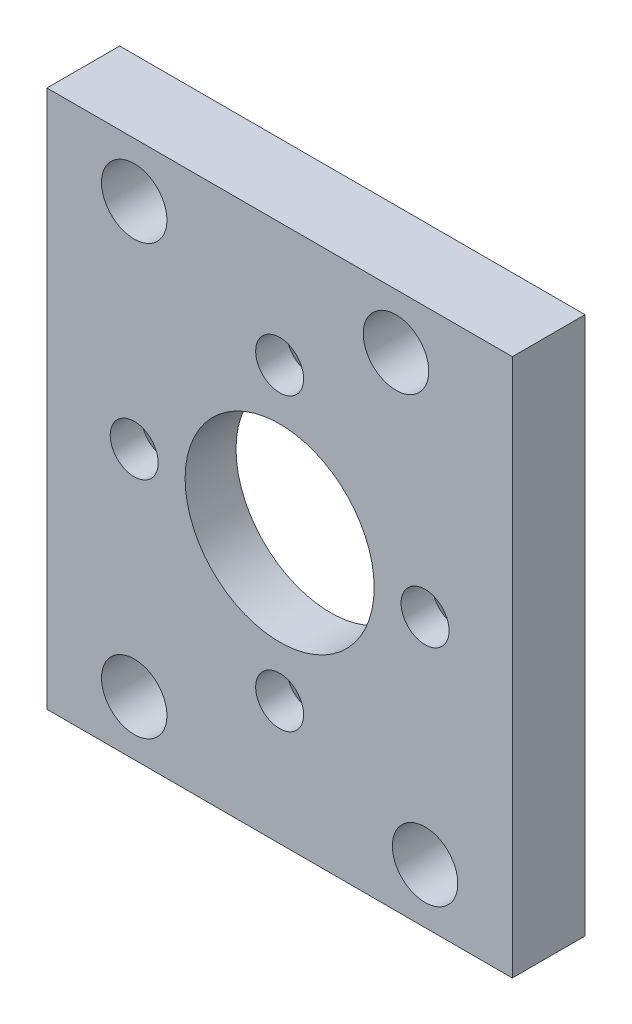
ISO-10303-21;
HEADER;
FILE_DESCRIPTION(('STEP AP214'),'2;1');
FILE_NAME('part.step','',(''),(''),'','','');
FILE_SCHEMA(('AUTOMOTIVE_DESIGN { 1 0 10303 214 1 1 1 1 }'));
ENDSEC;
DATA;
#1=APPLICATION_CONTEXT('core data for automotive mechanical design processes');
#2=APPLICATION_PROTOCOL_DEFINITION('international standard','automotive_design',2000,#1);
#3=PRODUCT_CONTEXT('',#1,'mechanical');
#4=PRODUCT('Part','Part','',(#3));
#5=PRODUCT_RELATED_PRODUCT_CATEGORY('part','',(#4));
#6=PRODUCT_DEFINITION_FORMATION('','',#4);
#7=PRODUCT_DEFINITION_CONTEXT('part definition',#1,'design');
#8=PRODUCT_DEFINITION('design','',#6,#7);
#9=PRODUCT_DEFINITION_SHAPE('','',#8);
#10=(LENGTH_UNIT() NAMED_UNIT(*) SI_UNIT(.MILLI.,.METRE.));
#11=(NAMED_UNIT(*) PLANE_ANGLE_UNIT() SI_UNIT($,.RADIAN.));
#12=(NAMED_UNIT(*) SI_UNIT($,.STERADIAN.) SOLID_ANGLE_UNIT());
#13=UNCERTAINTY_MEASURE_WITH_UNIT(LENGTH_MEASURE(1.E-05),#10,'distance_accuracy_value','');
#14=(GEOMETRIC_REPRESENTATION_CONTEXT(3) GLOBAL_UNCERTAINTY_ASSIGNED_CONTEXT((#13)) GLOBAL_UNIT_ASSIGNED_CONTEXT((#10,
#11,#12)) REPRESENTATION_CONTEXT('',''));
#15=CARTESIAN_POINT('',(0.,0.,0.));
#16=DIRECTION('',(0.,0.,1.));
#17=DIRECTION('',(1.,0.,0.));
#18=AXIS2_PLACEMENT_3D('',#15,#16,#17);
#19=CARTESIAN_POINT('',(-1.94289029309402E-13,-1.66533453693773E-13,5.));
#20=DIRECTION('',(0.,0.,-0.999999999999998));
#21=DIRECTION('',(-1.,0.,0.));
#22=AXIS2_PLACEMENT_3D('',#19,#20,#21);
#23=CYLINDRICAL_SURFACE('',#22,6.5);
#24=CARTESIAN_POINT('',(-1.94289029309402E-13,-1.66533453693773E-13,5.));
#25=DIRECTION('',(0.,0.,0.999999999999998));
#26=DIRECTION('',(1.,0.,0.));
#27=AXIS2_PLACEMENT_3D('',#24,#25,#26);
#28=CIRCLE('',#27,6.5);
#29=CARTESIAN_POINT('',(-6.50000000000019,-1.64368518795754E-13,5.));
#30=VERTEX_POINT('',#29);
#31=EDGE_CURVE('E181',#30,#30,#28,.T.);
#32=CARTESIAN_POINT('',(-1.66533453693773E-13,-1.66533453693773E-13,1.5));
#33=DIRECTION('',(0.,0.,-0.999999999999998));
#34=DIRECTION('',(-1.,0.,0.));
#35=AXIS2_PLACEMENT_3D('',#32,#33,#34);
#36=CIRCLE('',#35,6.5);
#37=CARTESIAN_POINT('',(-6.50000000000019,-1.63591362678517E-13,1.5));
#38=VERTEX_POINT('',#37);
#39=EDGE_CURVE('E576',#38,#38,#36,.T.);
#40=CARTESIAN_POINT('',(-6.50000000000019,-1.64368518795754E-13,5.));
#41=CARTESIAN_POINT('',(-6.50000000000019,-1.64360423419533E-13,4.96354166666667));
#42=CARTESIAN_POINT('',(-6.50000000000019,-1.64352328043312E-13,4.92708333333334));
#43=CARTESIAN_POINT('',(-6.50000000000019,-1.6433613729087E-13,4.85416666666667));
#44=CARTESIAN_POINT('',(-6.50000000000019,-1.64328041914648E-13,4.81770833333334));
#45=CARTESIAN_POINT('',(-6.50000000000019,-1.64311851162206E-13,4.74479166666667));
#46=CARTESIAN_POINT('',(-6.50000000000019,-1.64303755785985E-13,4.70833333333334));
#47=CARTESIAN_POINT('',(-6.50000000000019,-1.64287565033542E-13,4.63541666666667));
#48=CARTESIAN_POINT('',(-6.50000000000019,-1.64279469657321E-13,4.59895833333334));
#49=CARTESIAN_POINT('',(-6.50000000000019,-1.64263278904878E-13,4.52604166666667));
#50=CARTESIAN_POINT('',(-6.50000000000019,-1.64255183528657E-13,4.48958333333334));
#51=CARTESIAN_POINT('',(-6.50000000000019,-1.64238992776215E-13,4.41666666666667));
#52=CARTESIAN_POINT('',(-6.50000000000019,-1.64230897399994E-13,4.38020833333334));
#53=CARTESIAN_POINT('',(-6.50000000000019,-1.64214706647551E-13,4.30729166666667));
#54=CARTESIAN_POINT('',(-6.50000000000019,-1.6420661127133E-13,4.27083333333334));
#55=CARTESIAN_POINT('',(-6.50000000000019,-1.64190420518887E-13,4.19791666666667));
#56=CARTESIAN_POINT('',(-6.50000000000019,-1.64182325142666E-13,4.16145833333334));
#57=CARTESIAN_POINT('',(-6.50000000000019,-1.64166134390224E-13,4.08854166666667));
#58=CARTESIAN_POINT('',(-6.50000000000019,-1.64158039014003E-13,4.05208333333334));
#59=CARTESIAN_POINT('',(-6.50000000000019,-1.6414184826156E-13,3.97916666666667));
#60=CARTESIAN_POINT('',(-6.50000000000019,-1.64133752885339E-13,3.94270833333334));
#61=CARTESIAN_POINT('',(-6.50000000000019,-1.64117562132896E-13,3.86979166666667));
#62=CARTESIAN_POINT('',(-6.50000000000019,-1.64109466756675E-13,3.83333333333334));
#63=CARTESIAN_POINT('',(-6.50000000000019,-1.64093276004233E-13,3.76041666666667));
#64=CARTESIAN_POINT('',(-6.50000000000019,-1.64085180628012E-13,3.72395833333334));
#65=CARTESIAN_POINT('',(-6.50000000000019,-1.64068989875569E-13,3.65104166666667));
#66=CARTESIAN_POINT('',(-6.50000000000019,-1.64060894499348E-13,3.61458333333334));
#67=CARTESIAN_POINT('',(-6.50000000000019,-1.64044703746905E-13,3.54166666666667));
#68=CARTESIAN_POINT('',(-6.50000000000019,-1.64036608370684E-13,3.50520833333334));
#69=CARTESIAN_POINT('',(-6.50000000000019,-1.64020417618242E-13,3.43229166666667));
#70=CARTESIAN_POINT('',(-6.50000000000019,-1.64012322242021E-13,3.39583333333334));
#71=CARTESIAN_POINT('',(-6.50000000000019,-1.63996131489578E-13,3.32291666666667));
#72=CARTESIAN_POINT('',(-6.50000000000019,-1.63988036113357E-13,3.28645833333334));
#73=CARTESIAN_POINT('',(-6.50000000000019,-1.63971845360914E-13,3.21354166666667));
#74=CARTESIAN_POINT('',(-6.50000000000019,-1.63963749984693E-13,3.17708333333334));
#75=CARTESIAN_POINT('',(-6.50000000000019,-1.63947559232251E-13,3.10416666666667));
#76=CARTESIAN_POINT('',(-6.50000000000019,-1.6393946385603E-13,3.06770833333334));
#77=CARTESIAN_POINT('',(-6.50000000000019,-1.63923273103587E-13,2.99479166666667));
#78=CARTESIAN_POINT('',(-6.50000000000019,-1.63915177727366E-13,2.95833333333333));
#79=CARTESIAN_POINT('',(-6.50000000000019,-1.63898986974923E-13,2.88541666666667));
#80=CARTESIAN_POINT('',(-6.50000000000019,-1.63890891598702E-13,2.84895833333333));
#81=CARTESIAN_POINT('',(-6.50000000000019,-1.6387470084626E-13,2.77604166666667));
#82=CARTESIAN_POINT('',(-6.50000000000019,-1.63866605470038E-13,2.73958333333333));
#83=CARTESIAN_POINT('',(-6.50000000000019,-1.63850414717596E-13,2.66666666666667));
#84=CARTESIAN_POINT('',(-6.50000000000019,-1.63842319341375E-13,2.63020833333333));
#85=CARTESIAN_POINT('',(-6.50000000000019,-1.63826128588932E-13,2.55729166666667));
#86=CARTESIAN_POINT('',(-6.50000000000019,-1.63818033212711E-13,2.52083333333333));
#87=CARTESIAN_POINT('',(-6.50000000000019,-1.63801842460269E-13,2.44791666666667));
#88=CARTESIAN_POINT('',(-6.50000000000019,-1.63793747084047E-13,2.41145833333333));
#89=CARTESIAN_POINT('',(-6.50000000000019,-1.63777556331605E-13,2.33854166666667));
#90=CARTESIAN_POINT('',(-6.50000000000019,-1.63769460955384E-13,2.30208333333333));
#91=CARTESIAN_POINT('',(-6.50000000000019,-1.63753270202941E-13,2.22916666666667));
#92=CARTESIAN_POINT('',(-6.50000000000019,-1.6374517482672E-13,2.19270833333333));
#93=CARTESIAN_POINT('',(-6.50000000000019,-1.63728984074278E-13,2.11979166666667));
#94=CARTESIAN_POINT('',(-6.50000000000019,-1.63720888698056E-13,2.08333333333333));
#95=CARTESIAN_POINT('',(-6.50000000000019,-1.63704697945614E-13,2.01041666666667));
#96=CARTESIAN_POINT('',(-6.50000000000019,-1.63696602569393E-13,1.97395833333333));
#97=CARTESIAN_POINT('',(-6.50000000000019,-1.6368041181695E-13,1.90104166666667));
#98=CARTESIAN_POINT('',(-6.50000000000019,-1.63672316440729E-13,1.86458333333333));
#99=CARTESIAN_POINT('',(-6.50000000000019,-1.63656125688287E-13,1.79166666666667));
#100=CARTESIAN_POINT('',(-6.50000000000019,-1.63648030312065E-13,1.75520833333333));
#101=CARTESIAN_POINT('',(-6.50000000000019,-1.63631839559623E-13,1.68229166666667));
#102=CARTESIAN_POINT('',(-6.50000000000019,-1.63623744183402E-13,1.64583333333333));
#103=CARTESIAN_POINT('',(-6.50000000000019,-1.63607553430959E-13,1.57291666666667));
#104=CARTESIAN_POINT('',(-6.50000000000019,-1.63599458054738E-13,1.53645833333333));
#105=CARTESIAN_POINT('',(-6.50000000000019,-1.63591362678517E-13,1.5));
#106=B_SPLINE_CURVE_WITH_KNOTS('',3,(#40,#41,#42,#43,#44,#45,#46,#47,#48,#49,#50,#51,#52,#53,
#54,#55,#56,#57,#58,#59,#60,#61,#62,#63,#64,#65,#66,#67,#68,#69,#70,#71,#72,#73,#74,#75,#76,#77,
#78,#79,#80,#81,#82,#83,#84,#85,#86,#87,#88,#89,#90,#91,#92,#93,#94,#95,#96,#97,#98,#99,#100,
#101,#102,#103,#104,#105),.UNSPECIFIED.,.F.,.F.,(4,2,2,2,2,2,2,2,2,2,2,2,2,2,2,2,2,2,2,2,2,2,2,
2,2,2,2,2,2,2,2,2,4),(0.,0.109375,0.21875,0.328125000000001,0.4375,0.546875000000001,
0.656250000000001,0.765625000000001,0.875000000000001,0.984375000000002,1.09375,1.203125,1.3125,
1.421875,1.53125,1.640625,1.75,1.859375,1.96875,2.078125,2.1875,2.296875,2.40625,2.515625,2.625,
2.734375,2.84375,2.953125,3.0625,3.171875,3.28125,3.390625,3.5),.UNSPECIFIED.);
#107=EDGE_CURVE('BSEAM42',#30,#38,#106,.T.);
#108=ORIENTED_EDGE('',*,*,#31,.T.);
#109=ORIENTED_EDGE('',*,*,#39,.T.);
#110=ORIENTED_EDGE('',*,*,#107,.T.);
#111=ORIENTED_EDGE('',*,*,#107,.F.);
#112=EDGE_LOOP('',(#108,#110,#109,#111));
#113=FACE_BOUND('',#112,.T.);
#114=ADVANCED_FACE('F42',(#113),#23,.F.);
#115=CARTESIAN_POINT('',(-16.0000000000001,-18.5000000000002,5.));
#116=DIRECTION('',(0.,0.,-0.999999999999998));
#117=DIRECTION('',(-1.,0.,0.));
#118=AXIS2_PLACEMENT_3D('',#115,#116,#117);
#119=PLANE('',#118);
#120=CARTESIAN_POINT('',(-2.77555756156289E-13,-10.0000000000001,5.));
#121=DIRECTION('',(0.,0.,-0.999999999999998));
#122=DIRECTION('',(-1.,0.,0.));
#123=AXIS2_PLACEMENT_3D('',#120,#121,#122);
#124=CIRCLE('',#123,1.65);
#125=CARTESIAN_POINT('',(-1.65000000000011,-10.0000000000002,5.));
#126=VERTEX_POINT('',#125);
#127=EDGE_CURVE('E557',#126,#126,#124,.T.);
#128=ORIENTED_EDGE('',*,*,#127,.T.);
#129=EDGE_LOOP('',(#128));
#130=FACE_BOUND('',#129,.T.);
#131=CARTESIAN_POINT('',(9.99999999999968,-2.77555756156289E-13,5.));
#132=DIRECTION('',(0.,0.,-0.999999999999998));
#133=DIRECTION('',(-1.,0.,0.));
#134=AXIS2_PLACEMENT_3D('',#131,#132,#133);
#135=CIRCLE('',#134,1.65);
#136=CARTESIAN_POINT('',(8.34999999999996,-2.78116418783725E-13,5.));
#137=VERTEX_POINT('',#136);
#138=EDGE_CURVE('E549',#137,#137,#135,.T.);
#139=ORIENTED_EDGE('',*,*,#138,.T.);
#140=EDGE_LOOP('',(#139));
#141=FACE_BOUND('',#140,.T.);
#142=CARTESIAN_POINT('',(0.,9.99999999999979,5.));
#143=DIRECTION('',(0.,0.,-0.999999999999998));
#144=DIRECTION('',(-1.,0.,0.));
#145=AXIS2_PLACEMENT_3D('',#142,#143,#144);
#146=CIRCLE('',#145,1.65);
#147=CARTESIAN_POINT('',(-1.65000000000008,9.99999999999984,5.));
#148=VERTEX_POINT('',#147);
#149=EDGE_CURVE('E540',#148,#148,#146,.T.);
#150=ORIENTED_EDGE('',*,*,#149,.T.);
#151=EDGE_LOOP('',(#150));
#152=FACE_BOUND('',#151,.T.);
#153=CARTESIAN_POINT('',(-10.,-2.22044604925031E-13,5.));
#154=DIRECTION('',(0.,0.,-0.999999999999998));
#155=DIRECTION('',(-1.,0.,0.));
#156=AXIS2_PLACEMENT_3D('',#153,#154,#155);
#157=CIRCLE('',#156,1.65);
#158=CARTESIAN_POINT('',(-11.6500000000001,-1.67094116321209E-13,5.));
#159=VERTEX_POINT('',#158);
#160=EDGE_CURVE('E175',#159,#159,#157,.T.);
#161=ORIENTED_EDGE('',*,*,#160,.T.);
#162=EDGE_LOOP('',(#161));
#163=FACE_BOUND('',#162,.T.);
#164=ORIENTED_EDGE('',*,*,#31,.F.);
#165=EDGE_LOOP('',(#164));
#166=FACE_BOUND('',#165,.T.);
#167=CARTESIAN_POINT('',(10.0000000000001,-14.7500000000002,5.));
#168=DIRECTION('',(0.,0.,0.999999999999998));
#169=DIRECTION('',(1.,0.,0.));
#170=AXIS2_PLACEMENT_3D('',#167,#168,#169);
#171=CIRCLE('',#170,2.24999999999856);
#172=CARTESIAN_POINT('',(7.75000000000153,-14.7500000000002,5.));
#173=VERTEX_POINT('',#172);
#174=EDGE_CURVE('E193',#173,#173,#171,.T.);
#175=ORIENTED_EDGE('',*,*,#174,.F.);
#176=EDGE_LOOP('',(#175));
#177=FACE_BOUND('',#176,.T.);
#178=DIRECTION('',(0.,-1.,0.));
#179=VECTOR('',#178,1.);
#180=CARTESIAN_POINT('',(-16.0000000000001,18.4999999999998,5.));
#181=LINE('',#180,#179);
#182=CARTESIAN_POINT('',(-16.0000000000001,18.4999999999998,5.));
#183=VERTEX_POINT('',#182);
#184=CARTESIAN_POINT('',(-16.0000000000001,-18.5000000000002,5.));
#185=VERTEX_POINT('',#184);
#186=EDGE_CURVE('E211',#183,#185,#181,.T.);
#187=ORIENTED_EDGE('',*,*,#186,.T.);
#188=DIRECTION('',(1.,0.,0.));
#189=VECTOR('',#188,1.);
#190=CARTESIAN_POINT('',(16.,-18.5000000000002,5.));
#191=LINE('',#190,#189);
#192=CARTESIAN_POINT('',(16.,-18.5000000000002,5.));
#193=VERTEX_POINT('',#192);
#194=EDGE_CURVE('E213',#185,#193,#191,.T.);
#195=ORIENTED_EDGE('',*,*,#194,.T.);
#196=DIRECTION('',(0.,1.,0.));
#197=VECTOR('',#196,1.);
#198=CARTESIAN_POINT('',(16.,-18.5000000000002,5.));
#199=LINE('',#198,#197);
#200=CARTESIAN_POINT('',(15.9999999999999,18.4999999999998,5.));
#201=VERTEX_POINT('',#200);
#202=EDGE_CURVE('E215',#193,#201,#199,.T.);
#203=ORIENTED_EDGE('',*,*,#202,.T.);
#204=DIRECTION('',(-1.,0.,0.));
#205=VECTOR('',#204,1.);
#206=CARTESIAN_POINT('',(15.9999999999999,18.4999999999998,5.));
#207=LINE('',#206,#205);
#208=EDGE_CURVE('E71',#201,#183,#207,.T.);
#209=ORIENTED_EDGE('',*,*,#208,.T.);
#210=EDGE_LOOP('',(#187,#195,#203,#209));
#211=FACE_BOUND('',#210,.T.);
#212=CARTESIAN_POINT('',(-10.,14.75,5.));
#213=DIRECTION('',(0.,0.,0.999999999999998));
#214=DIRECTION('',(1.,0.,0.));
#215=AXIS2_PLACEMENT_3D('',#212,#213,#214);
#216=CIRCLE('',#215,2.25);
#217=CARTESIAN_POINT('',(-12.25,14.75,5.));
#218=VERTEX_POINT('',#217);
#219=EDGE_CURVE('E199',#218,#218,#216,.T.);
#220=ORIENTED_EDGE('',*,*,#219,.F.);
#221=EDGE_LOOP('',(#220));
#222=FACE_BOUND('',#221,.T.);
#223=CARTESIAN_POINT('',(-10.0000000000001,-14.7500000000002,5.));
#224=DIRECTION('',(0.,0.,0.999999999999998));
#225=DIRECTION('',(1.,0.,0.));
#226=AXIS2_PLACEMENT_3D('',#223,#224,#225);
#227=CIRCLE('',#226,2.24999999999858);
#228=CARTESIAN_POINT('',(-12.2499999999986,-14.7500000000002,5.));
#229=VERTEX_POINT('',#228);
#230=EDGE_CURVE('E187',#229,#229,#227,.T.);
#231=ORIENTED_EDGE('',*,*,#230,.F.);
#232=EDGE_LOOP('',(#231));
#233=FACE_BOUND('',#232,.T.);
#234=CARTESIAN_POINT('',(7.99999999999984,14.7499999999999,5.));
#235=DIRECTION('',(0.,0.,0.999999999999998));
#236=DIRECTION('',(1.,0.,0.));
#237=AXIS2_PLACEMENT_3D('',#234,#235,#236);
#238=CIRCLE('',#237,2.25);
#239=CARTESIAN_POINT('',(5.74999999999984,14.7499999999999,5.));
#240=VERTEX_POINT('',#239);
#241=EDGE_CURVE('E172',#240,#240,#238,.T.);
#242=ORIENTED_EDGE('',*,*,#241,.F.);
#243=EDGE_LOOP('',(#242));
#244=FACE_BOUND('',#243,.T.);
#245=ADVANCED_FACE('F305',(#130,#141,#152,#163,#166,#177,#211,#222,#233,#244),#119,.F.);
#246=CARTESIAN_POINT('',(-16.0000000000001,-18.5000000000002,1.11022302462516E-13));
#247=DIRECTION('',(0.,0.,-0.999999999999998));
#248=DIRECTION('',(-1.,0.,0.));
#249=AXIS2_PLACEMENT_3D('',#246,#247,#248);
#250=PLANE('',#249);
#251=CARTESIAN_POINT('',(0.,-1.66533453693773E-13,0.));
#252=DIRECTION('',(0.,0.,-0.999999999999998));
#253=DIRECTION('',(-1.,0.,0.));
#254=AXIS2_PLACEMENT_3D('',#251,#252,#253);
#255=CIRCLE('',#254,11.);
#256=CARTESIAN_POINT('',(-10.0375,4.49984374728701,0.));
#257=VERTEX_POINT('',#256);
#258=CARTESIAN_POINT('',(-4.49984374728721,10.0374999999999,0.));
#259=VERTEX_POINT('',#258);
#260=EDGE_CURVE('E141',#257,#259,#255,.T.);
#261=ORIENTED_EDGE('',*,*,#260,.F.);
#262=CARTESIAN_POINT('',(-10.0000000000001,-1.66533453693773E-13,0.));
#263=DIRECTION('',(0.,0.,-0.999999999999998));
#264=DIRECTION('',(-1.,0.,0.));
#265=AXIS2_PLACEMENT_3D('',#262,#263,#264);
#266=CIRCLE('',#265,4.5);
#267=CARTESIAN_POINT('',(-10.0375,-4.49984374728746,0.));
#268=VERTEX_POINT('',#267);
#269=EDGE_CURVE('E157',#268,#257,#266,.T.);
#270=ORIENTED_EDGE('',*,*,#269,.F.);
#271=CARTESIAN_POINT('',(-4.49984374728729,-10.0375000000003,0.));
#272=VERTEX_POINT('',#271);
#273=EDGE_CURVE('E164',#272,#268,#255,.T.);
#274=ORIENTED_EDGE('',*,*,#273,.F.);
#275=CARTESIAN_POINT('',(-1.11022302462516E-13,-10.0000000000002,0.));
#276=DIRECTION('',(0.,0.,-0.999999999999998));
#277=DIRECTION('',(-1.,0.,0.));
#278=AXIS2_PLACEMENT_3D('',#275,#276,#277);
#279=CIRCLE('',#278,4.5);
#280=CARTESIAN_POINT('',(4.49984374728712,-10.0375000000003,0.));
#281=VERTEX_POINT('',#280);
#282=EDGE_CURVE('E552',#281,#272,#279,.T.);
#283=ORIENTED_EDGE('',*,*,#282,.F.);
#284=CARTESIAN_POINT('',(10.0374999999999,-4.49984374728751,0.));
#285=VERTEX_POINT('',#284);
#286=EDGE_CURVE('E594',#285,#281,#255,.T.);
#287=ORIENTED_EDGE('',*,*,#286,.F.);
#288=CARTESIAN_POINT('',(9.99999999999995,-2.77555756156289E-13,0.));
#289=DIRECTION('',(0.,0.,-0.999999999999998));
#290=DIRECTION('',(-1.,0.,0.));
#291=AXIS2_PLACEMENT_3D('',#288,#289,#290);
#292=CIRCLE('',#291,4.5);
#293=CARTESIAN_POINT('',(10.0375,4.49984374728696,0.));
#294=VERTEX_POINT('',#293);
#295=EDGE_CURVE('E543',#294,#285,#292,.T.);
#296=ORIENTED_EDGE('',*,*,#295,.F.);
#297=CARTESIAN_POINT('',(4.49984374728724,10.0374999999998,1.11022302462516E-13));
#298=VERTEX_POINT('',#297);
#299=EDGE_CURVE('E162',#298,#294,#255,.T.);
#300=ORIENTED_EDGE('',*,*,#299,.F.);
#301=CARTESIAN_POINT('',(0.,9.99999999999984,0.));
#302=DIRECTION('',(0.,0.,-0.999999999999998));
#303=DIRECTION('',(-1.,0.,0.));
#304=AXIS2_PLACEMENT_3D('',#301,#302,#303);
#305=CIRCLE('',#304,4.5);
#306=EDGE_CURVE('E160',#259,#298,#305,.T.);
#307=ORIENTED_EDGE('',*,*,#306,.F.);
#308=EDGE_LOOP('',(#261,#270,#274,#283,#287,#296,#300,#307));
#309=FACE_BOUND('',#308,.T.);
#310=CARTESIAN_POINT('',(9.99999999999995,-14.7500000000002,0.));
#311=DIRECTION('',(0.,0.,0.999999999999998));
#312=DIRECTION('',(1.,0.,0.));
#313=AXIS2_PLACEMENT_3D('',#310,#311,#312);
#314=CIRCLE('',#313,2.24999999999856);
#315=CARTESIAN_POINT('',(7.75000000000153,-14.7500000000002,0.));
#316=VERTEX_POINT('',#315);
#317=EDGE_CURVE('E190',#316,#316,#314,.T.);
#318=ORIENTED_EDGE('',*,*,#317,.T.);
#319=EDGE_LOOP('',(#318));
#320=FACE_BOUND('',#319,.T.);
#321=DIRECTION('',(0.,-1.,0.));
#322=VECTOR('',#321,1.);
#323=CARTESIAN_POINT('',(-16.0000000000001,18.4999999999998,0.));
#324=LINE('',#323,#322);
#325=CARTESIAN_POINT('',(-16.0000000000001,18.4999999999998,0.));
#326=VERTEX_POINT('',#325);
#327=CARTESIAN_POINT('',(-16.0000000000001,-18.5000000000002,1.11022302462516E-13));
#328=VERTEX_POINT('',#327);
#329=EDGE_CURVE('E202',#326,#328,#324,.T.);
#330=ORIENTED_EDGE('',*,*,#329,.F.);
#331=DIRECTION('',(-1.,0.,0.));
#332=VECTOR('',#331,1.);
#333=CARTESIAN_POINT('',(16.,18.4999999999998,0.));
#334=LINE('',#333,#332);
#335=CARTESIAN_POINT('',(16.,18.4999999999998,0.));
#336=VERTEX_POINT('',#335);
#337=EDGE_CURVE('E209',#336,#326,#334,.T.);
#338=ORIENTED_EDGE('',*,*,#337,.F.);
#339=DIRECTION('',(0.,1.,0.));
#340=VECTOR('',#339,1.);
#341=CARTESIAN_POINT('',(16.,-18.5000000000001,0.));
#342=LINE('',#341,#340);
#343=CARTESIAN_POINT('',(16.,-18.5000000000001,0.));
#344=VERTEX_POINT('',#343);
#345=EDGE_CURVE('E207',#344,#336,#342,.T.);
#346=ORIENTED_EDGE('',*,*,#345,.F.);
#347=DIRECTION('',(1.,0.,0.));
#348=VECTOR('',#347,1.);
#349=CARTESIAN_POINT('',(16.,-18.5000000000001,0.));
#350=LINE('',#349,#348);
#351=EDGE_CURVE('E205',#328,#344,#350,.T.);
#352=ORIENTED_EDGE('',*,*,#351,.F.);
#353=EDGE_LOOP('',(#330,#338,#346,#352));
#354=FACE_BOUND('',#353,.T.);
#355=CARTESIAN_POINT('',(-10.0000000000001,14.7499999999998,0.));
#356=DIRECTION('',(0.,0.,0.999999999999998));
#357=DIRECTION('',(1.,0.,0.));
#358=AXIS2_PLACEMENT_3D('',#355,#356,#357);
#359=CIRCLE('',#358,2.25);
#360=CARTESIAN_POINT('',(-12.25,14.75,0.));
#361=VERTEX_POINT('',#360);
#362=EDGE_CURVE('E196',#361,#361,#359,.T.);
#363=ORIENTED_EDGE('',*,*,#362,.T.);
#364=EDGE_LOOP('',(#363));
#365=FACE_BOUND('',#364,.T.);
#366=CARTESIAN_POINT('',(-10.,-14.7500000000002,0.));
#367=DIRECTION('',(0.,0.,0.999999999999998));
#368=DIRECTION('',(1.,0.,0.));
#369=AXIS2_PLACEMENT_3D('',#366,#367,#368);
#370=CIRCLE('',#369,2.24999999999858);
#371=CARTESIAN_POINT('',(-12.2499999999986,-14.7500000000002,0.));
#372=VERTEX_POINT('',#371);
#373=EDGE_CURVE('E184',#372,#372,#370,.T.);
#374=ORIENTED_EDGE('',*,*,#373,.T.);
#375=EDGE_LOOP('',(#374));
#376=FACE_BOUND('',#375,.T.);
#377=CARTESIAN_POINT('',(7.99999999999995,14.7499999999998,0.));
#378=DIRECTION('',(0.,0.,0.999999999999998));
#379=DIRECTION('',(1.,0.,0.));
#380=AXIS2_PLACEMENT_3D('',#377,#378,#379);
#381=CIRCLE('',#380,2.25);
#382=CARTESIAN_POINT('',(5.74999999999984,14.7499999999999,0.));
#383=VERTEX_POINT('',#382);
#384=EDGE_CURVE('E168',#383,#383,#381,.T.);
#385=ORIENTED_EDGE('',*,*,#384,.T.);
#386=EDGE_LOOP('',(#385));
#387=FACE_BOUND('',#386,.T.);
#388=ADVANCED_FACE('F154',(#309,#320,#354,#365,#376,#387),#250,.T.);
#389=CARTESIAN_POINT('',(-16.0000000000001,18.4999999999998,5.));
#390=DIRECTION('',(1.,0.,0.));
#391=DIRECTION('',(0.,1.,0.));
#392=AXIS2_PLACEMENT_3D('',#389,#390,#391);
#393=PLANE('',#392);
#394=ORIENTED_EDGE('',*,*,#329,.T.);
#395=DIRECTION('',(0.,0.,-0.999999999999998));
#396=VECTOR('',#395,1.);
#397=CARTESIAN_POINT('',(-16.0000000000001,-18.5000000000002,5.));
#398=LINE('',#397,#396);
#399=EDGE_CURVE('E227',#185,#328,#398,.T.);
#400=ORIENTED_EDGE('',*,*,#399,.F.);
#401=ORIENTED_EDGE('',*,*,#186,.F.);
#402=DIRECTION('',(0.,0.,-0.999999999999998));
#403=VECTOR('',#402,1.);
#404=CARTESIAN_POINT('',(-16.0000000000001,18.4999999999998,5.));
#405=LINE('',#404,#403);
#406=EDGE_CURVE('E218',#183,#326,#405,.T.);
#407=ORIENTED_EDGE('',*,*,#406,.T.);
#408=EDGE_LOOP('',(#394,#400,#401,#407));
#409=FACE_BOUND('',#408,.T.);
#410=ADVANCED_FACE('F44',(#409),#393,.F.);
#411=CARTESIAN_POINT('',(16.,-18.5000000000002,5.));
#412=DIRECTION('',(0.,1.,0.));
#413=DIRECTION('',(-1.,0.,0.));
#414=AXIS2_PLACEMENT_3D('',#411,#412,#413);
#415=PLANE('',#414);
#416=ORIENTED_EDGE('',*,*,#351,.T.);
#417=DIRECTION('',(0.,0.,-0.999999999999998));
#418=VECTOR('',#417,1.);
#419=CARTESIAN_POINT('',(16.,-18.5000000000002,5.));
#420=LINE('',#419,#418);
#421=EDGE_CURVE('E224',#193,#344,#420,.T.);
#422=ORIENTED_EDGE('',*,*,#421,.F.);
#423=ORIENTED_EDGE('',*,*,#194,.F.);
#424=ORIENTED_EDGE('',*,*,#399,.T.);
#425=EDGE_LOOP('',(#416,#422,#423,#424));
#426=FACE_BOUND('',#425,.T.);
#427=ADVANCED_FACE('F329',(#426),#415,.F.);
#428=CARTESIAN_POINT('',(16.,-18.5000000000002,5.));
#429=DIRECTION('',(-1.,0.,0.));
#430=DIRECTION('',(0.,0.,0.999999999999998));
#431=AXIS2_PLACEMENT_3D('',#428,#429,#430);
#432=PLANE('',#431);
#433=ORIENTED_EDGE('',*,*,#345,.T.);
#434=DIRECTION('',(0.,0.,-0.999999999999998));
#435=VECTOR('',#434,1.);
#436=CARTESIAN_POINT('',(15.9999999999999,18.4999999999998,5.));
#437=LINE('',#436,#435);
#438=EDGE_CURVE('E221',#201,#336,#437,.T.);
#439=ORIENTED_EDGE('',*,*,#438,.F.);
#440=ORIENTED_EDGE('',*,*,#202,.F.);
#441=ORIENTED_EDGE('',*,*,#421,.T.);
#442=EDGE_LOOP('',(#433,#439,#440,#441));
#443=FACE_BOUND('',#442,.T.);
#444=ADVANCED_FACE('F326',(#443),#432,.F.);
#445=CARTESIAN_POINT('',(15.9999999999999,18.4999999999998,5.));
#446=DIRECTION('',(0.,-1.,0.));
#447=DIRECTION('',(1.,0.,0.));
#448=AXIS2_PLACEMENT_3D('',#445,#446,#447);
#449=PLANE('',#448);
#450=ORIENTED_EDGE('',*,*,#337,.T.);
#451=ORIENTED_EDGE('',*,*,#406,.F.);
#452=ORIENTED_EDGE('',*,*,#208,.F.);
#453=ORIENTED_EDGE('',*,*,#438,.T.);
#454=EDGE_LOOP('',(#450,#451,#452,#453));
#455=FACE_BOUND('',#454,.T.);
#456=ADVANCED_FACE('F317',(#455),#449,.F.);
#457=CARTESIAN_POINT('',(-10.,14.75,5.));
#458=DIRECTION('',(0.,0.,-0.999999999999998));
#459=DIRECTION('',(-1.,0.,0.));
#460=AXIS2_PLACEMENT_3D('',#457,#458,#459);
#461=CYLINDRICAL_SURFACE('',#460,2.25);
#462=CARTESIAN_POINT('',(-12.25,14.75,5.));
#463=CARTESIAN_POINT('',(-12.25,14.75,4.94791666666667));
#464=CARTESIAN_POINT('',(-12.25,14.75,4.89583333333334));
#465=CARTESIAN_POINT('',(-12.25,14.75,4.79166666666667));
#466=CARTESIAN_POINT('',(-12.25,14.75,4.73958333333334));
#467=CARTESIAN_POINT('',(-12.25,14.75,4.63541666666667));
#468=CARTESIAN_POINT('',(-12.25,14.75,4.58333333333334));
#469=CARTESIAN_POINT('',(-12.25,14.75,4.47916666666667));
#470=CARTESIAN_POINT('',(-12.25,14.75,4.42708333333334));
#471=CARTESIAN_POINT('',(-12.25,14.75,4.32291666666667));
#472=CARTESIAN_POINT('',(-12.25,14.75,4.27083333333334));
#473=CARTESIAN_POINT('',(-12.25,14.75,4.16666666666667));
#474=CARTESIAN_POINT('',(-12.25,14.75,4.11458333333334));
#475=CARTESIAN_POINT('',(-12.25,14.75,4.01041666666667));
#476=CARTESIAN_POINT('',(-12.25,14.75,3.95833333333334));
#477=CARTESIAN_POINT('',(-12.25,14.75,3.85416666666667));
#478=CARTESIAN_POINT('',(-12.25,14.75,3.80208333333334));
#479=CARTESIAN_POINT('',(-12.25,14.75,3.69791666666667));
#480=CARTESIAN_POINT('',(-12.25,14.75,3.64583333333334));
#481=CARTESIAN_POINT('',(-12.25,14.75,3.54166666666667));
#482=CARTESIAN_POINT('',(-12.25,14.75,3.48958333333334));
#483=CARTESIAN_POINT('',(-12.25,14.75,3.38541666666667));
#484=CARTESIAN_POINT('',(-12.25,14.75,3.33333333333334));
#485=CARTESIAN_POINT('',(-12.25,14.75,3.22916666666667));
#486=CARTESIAN_POINT('',(-12.25,14.75,3.17708333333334));
#487=CARTESIAN_POINT('',(-12.25,14.75,3.07291666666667));
#488=CARTESIAN_POINT('',(-12.25,14.75,3.02083333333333));
#489=CARTESIAN_POINT('',(-12.25,14.75,2.91666666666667));
#490=CARTESIAN_POINT('',(-12.25,14.75,2.86458333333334));
#491=CARTESIAN_POINT('',(-12.25,14.75,2.76041666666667));
#492=CARTESIAN_POINT('',(-12.25,14.75,2.70833333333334));
#493=CARTESIAN_POINT('',(-12.25,14.75,2.60416666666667));
#494=CARTESIAN_POINT('',(-12.25,14.75,2.55208333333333));
#495=CARTESIAN_POINT('',(-12.25,14.75,2.44791666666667));
#496=CARTESIAN_POINT('',(-12.25,14.75,2.39583333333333));
#497=CARTESIAN_POINT('',(-12.25,14.75,2.29166666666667));
#498=CARTESIAN_POINT('',(-12.25,14.75,2.23958333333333));
#499=CARTESIAN_POINT('',(-12.25,14.75,2.13541666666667));
#500=CARTESIAN_POINT('',(-12.25,14.75,2.08333333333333));
#501=CARTESIAN_POINT('',(-12.25,14.75,1.97916666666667));
#502=CARTESIAN_POINT('',(-12.25,14.75,1.92708333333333));
#503=CARTESIAN_POINT('',(-12.25,14.75,1.82291666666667));
#504=CARTESIAN_POINT('',(-12.25,14.75,1.77083333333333));
#505=CARTESIAN_POINT('',(-12.25,14.75,1.66666666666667));
#506=CARTESIAN_POINT('',(-12.25,14.75,1.61458333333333));
#507=CARTESIAN_POINT('',(-12.25,14.75,1.51041666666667));
#508=CARTESIAN_POINT('',(-12.25,14.75,1.45833333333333));
#509=CARTESIAN_POINT('',(-12.25,14.75,1.35416666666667));
#510=CARTESIAN_POINT('',(-12.25,14.75,1.30208333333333));
#511=CARTESIAN_POINT('',(-12.25,14.75,1.19791666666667));
#512=CARTESIAN_POINT('',(-12.25,14.75,1.14583333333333));
#513=CARTESIAN_POINT('',(-12.25,14.75,1.04166666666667));
#514=CARTESIAN_POINT('',(-12.25,14.75,0.989583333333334));
#515=CARTESIAN_POINT('',(-12.25,14.75,0.885416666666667));
#516=CARTESIAN_POINT('',(-12.25,14.75,0.833333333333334));
#517=CARTESIAN_POINT('',(-12.25,14.75,0.729166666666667));
#518=CARTESIAN_POINT('',(-12.25,14.75,0.677083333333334));
#519=CARTESIAN_POINT('',(-12.25,14.75,0.572916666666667));
#520=CARTESIAN_POINT('',(-12.25,14.75,0.520833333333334));
#521=CARTESIAN_POINT('',(-12.25,14.75,0.416666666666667));
#522=CARTESIAN_POINT('',(-12.25,14.75,0.364583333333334));
#523=CARTESIAN_POINT('',(-12.25,14.75,0.260416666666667));
#524=CARTESIAN_POINT('',(-12.25,14.75,0.208333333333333));
#525=CARTESIAN_POINT('',(-12.25,14.75,0.104166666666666));
#526=CARTESIAN_POINT('',(-12.25,14.75,0.0520833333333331));
#527=CARTESIAN_POINT('',(-12.25,14.75,0.));
#528=B_SPLINE_CURVE_WITH_KNOTS('',3,(#462,#463,#464,#465,#466,#467,#468,#469,#470,#471,#472,
#473,#474,#475,#476,#477,#478,#479,#480,#481,#482,#483,#484,#485,#486,#487,#488,#489,#490,#491,
#492,#493,#494,#495,#496,#497,#498,#499,#500,#501,#502,#503,#504,#505,#506,#507,#508,#509,#510,
#511,#512,#513,#514,#515,#516,#517,#518,#519,#520,#521,#522,#523,#524,#525,#526,#527),
.UNSPECIFIED.,.F.,.F.,(4,2,2,2,2,2,2,2,2,2,2,2,2,2,2,2,2,2,2,2,2,2,2,2,2,2,2,2,2,2,2,2,4),(0.,
0.15625,0.3125,0.468750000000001,0.625000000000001,0.781250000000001,0.937500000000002,1.09375,
1.25,1.40625,1.5625,1.71875,1.875,2.03125,2.1875,2.34375,2.5,2.65625,2.8125,2.96875,3.125,
3.28125,3.4375,3.59375,3.75,3.90625,4.0625,4.21875,4.375,4.53125,4.6875,4.84375000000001,5.),.UNSPECIFIED.);
#529=EDGE_CURVE('BSEAM313',#218,#361,#528,.T.);
#530=ORIENTED_EDGE('',*,*,#219,.T.);
#531=ORIENTED_EDGE('',*,*,#362,.F.);
#532=ORIENTED_EDGE('',*,*,#529,.T.);
#533=ORIENTED_EDGE('',*,*,#529,.F.);
#534=EDGE_LOOP('',(#530,#532,#531,#533));
#535=FACE_BOUND('',#534,.T.);
#536=ADVANCED_FACE('F313',(#535),#461,.F.);
#537=CARTESIAN_POINT('',(10.0000000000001,-14.7500000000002,5.));
#538=DIRECTION('',(0.,0.,-0.999999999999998));
#539=DIRECTION('',(-1.,0.,0.));
#540=AXIS2_PLACEMENT_3D('',#537,#538,#539);
#541=CYLINDRICAL_SURFACE('',#540,2.24999999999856);
#542=CARTESIAN_POINT('',(7.75000000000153,-14.7500000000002,5.));
#543=CARTESIAN_POINT('',(7.75000000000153,-14.7500000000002,4.94791666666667));
#544=CARTESIAN_POINT('',(7.75000000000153,-14.7500000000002,4.89583333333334));
#545=CARTESIAN_POINT('',(7.75000000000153,-14.7500000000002,4.79166666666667));
#546=CARTESIAN_POINT('',(7.75000000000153,-14.7500000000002,4.73958333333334));
#547=CARTESIAN_POINT('',(7.75000000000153,-14.7500000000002,4.63541666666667));
#548=CARTESIAN_POINT('',(7.75000000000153,-14.7500000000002,4.58333333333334));
#549=CARTESIAN_POINT('',(7.75000000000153,-14.7500000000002,4.47916666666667));
#550=CARTESIAN_POINT('',(7.75000000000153,-14.7500000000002,4.42708333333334));
#551=CARTESIAN_POINT('',(7.75000000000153,-14.7500000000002,4.32291666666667));
#552=CARTESIAN_POINT('',(7.75000000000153,-14.7500000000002,4.27083333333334));
#553=CARTESIAN_POINT('',(7.75000000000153,-14.7500000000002,4.16666666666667));
#554=CARTESIAN_POINT('',(7.75000000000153,-14.7500000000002,4.11458333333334));
#555=CARTESIAN_POINT('',(7.75000000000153,-14.7500000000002,4.01041666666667));
#556=CARTESIAN_POINT('',(7.75000000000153,-14.7500000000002,3.95833333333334));
#557=CARTESIAN_POINT('',(7.75000000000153,-14.7500000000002,3.85416666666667));
#558=CARTESIAN_POINT('',(7.75000000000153,-14.7500000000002,3.80208333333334));
#559=CARTESIAN_POINT('',(7.75000000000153,-14.7500000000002,3.69791666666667));
#560=CARTESIAN_POINT('',(7.75000000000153,-14.7500000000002,3.64583333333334));
#561=CARTESIAN_POINT('',(7.75000000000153,-14.7500000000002,3.54166666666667));
#562=CARTESIAN_POINT('',(7.75000000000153,-14.7500000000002,3.48958333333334));
#563=CARTESIAN_POINT('',(7.75000000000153,-14.7500000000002,3.38541666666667));
#564=CARTESIAN_POINT('',(7.75000000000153,-14.7500000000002,3.33333333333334));
#565=CARTESIAN_POINT('',(7.75000000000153,-14.7500000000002,3.22916666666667));
#566=CARTESIAN_POINT('',(7.75000000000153,-14.7500000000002,3.17708333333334));
#567=CARTESIAN_POINT('',(7.75000000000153,-14.7500000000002,3.07291666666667));
#568=CARTESIAN_POINT('',(7.75000000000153,-14.7500000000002,3.02083333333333));
#569=CARTESIAN_POINT('',(7.75000000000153,-14.7500000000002,2.91666666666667));
#570=CARTESIAN_POINT('',(7.75000000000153,-14.7500000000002,2.86458333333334));
#571=CARTESIAN_POINT('',(7.75000000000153,-14.7500000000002,2.76041666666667));
#572=CARTESIAN_POINT('',(7.75000000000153,-14.7500000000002,2.70833333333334));
#573=CARTESIAN_POINT('',(7.75000000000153,-14.7500000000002,2.60416666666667));
#574=CARTESIAN_POINT('',(7.75000000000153,-14.7500000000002,2.55208333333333));
#575=CARTESIAN_POINT('',(7.75000000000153,-14.7500000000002,2.44791666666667));
#576=CARTESIAN_POINT('',(7.75000000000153,-14.7500000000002,2.39583333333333));
#577=CARTESIAN_POINT('',(7.75000000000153,-14.7500000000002,2.29166666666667));
#578=CARTESIAN_POINT('',(7.75000000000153,-14.7500000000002,2.23958333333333));
#579=CARTESIAN_POINT('',(7.75000000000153,-14.7500000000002,2.13541666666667));
#580=CARTESIAN_POINT('',(7.75000000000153,-14.7500000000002,2.08333333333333));
#581=CARTESIAN_POINT('',(7.75000000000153,-14.7500000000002,1.97916666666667));
#582=CARTESIAN_POINT('',(7.75000000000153,-14.7500000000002,1.92708333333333));
#583=CARTESIAN_POINT('',(7.75000000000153,-14.7500000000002,1.82291666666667));
#584=CARTESIAN_POINT('',(7.75000000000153,-14.7500000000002,1.77083333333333));
#585=CARTESIAN_POINT('',(7.75000000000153,-14.7500000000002,1.66666666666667));
#586=CARTESIAN_POINT('',(7.75000000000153,-14.7500000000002,1.61458333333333));
#587=CARTESIAN_POINT('',(7.75000000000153,-14.7500000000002,1.51041666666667));
#588=CARTESIAN_POINT('',(7.75000000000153,-14.7500000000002,1.45833333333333));
#589=CARTESIAN_POINT('',(7.75000000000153,-14.7500000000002,1.35416666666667));
#590=CARTESIAN_POINT('',(7.75000000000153,-14.7500000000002,1.30208333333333));
#591=CARTESIAN_POINT('',(7.75000000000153,-14.7500000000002,1.19791666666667));
#592=CARTESIAN_POINT('',(7.75000000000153,-14.7500000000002,1.14583333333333));
#593=CARTESIAN_POINT('',(7.75000000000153,-14.7500000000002,1.04166666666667));
#594=CARTESIAN_POINT('',(7.75000000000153,-14.7500000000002,0.989583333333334));
#595=CARTESIAN_POINT('',(7.75000000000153,-14.7500000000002,0.885416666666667));
#596=CARTESIAN_POINT('',(7.75000000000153,-14.7500000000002,0.833333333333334));
#597=CARTESIAN_POINT('',(7.75000000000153,-14.7500000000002,0.729166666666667));
#598=CARTESIAN_POINT('',(7.75000000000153,-14.7500000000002,0.677083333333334));
#599=CARTESIAN_POINT('',(7.75000000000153,-14.7500000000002,0.572916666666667));
#600=CARTESIAN_POINT('',(7.75000000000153,-14.7500000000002,0.520833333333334));
#601=CARTESIAN_POINT('',(7.75000000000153,-14.7500000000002,0.416666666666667));
#602=CARTESIAN_POINT('',(7.75000000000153,-14.7500000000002,0.364583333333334));
#603=CARTESIAN_POINT('',(7.75000000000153,-14.7500000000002,0.260416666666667));
#604=CARTESIAN_POINT('',(7.75000000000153,-14.7500000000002,0.208333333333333));
#605=CARTESIAN_POINT('',(7.75000000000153,-14.7500000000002,0.104166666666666));
#606=CARTESIAN_POINT('',(7.75000000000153,-14.7500000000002,0.0520833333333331));
#607=CARTESIAN_POINT('',(7.75000000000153,-14.7500000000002,0.));
#608=B_SPLINE_CURVE_WITH_KNOTS('',3,(#542,#543,#544,#545,#546,#547,#548,#549,#550,#551,#552,
#553,#554,#555,#556,#557,#558,#559,#560,#561,#562,#563,#564,#565,#566,#567,#568,#569,#570,#571,
#572,#573,#574,#575,#576,#577,#578,#579,#580,#581,#582,#583,#584,#585,#586,#587,#588,#589,#590,
#591,#592,#593,#594,#595,#596,#597,#598,#599,#600,#601,#602,#603,#604,#605,#606,#607),
.UNSPECIFIED.,.F.,.F.,(4,2,2,2,2,2,2,2,2,2,2,2,2,2,2,2,2,2,2,2,2,2,2,2,2,2,2,2,2,2,2,2,4),(0.,
0.15625,0.3125,0.468750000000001,0.625000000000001,0.781250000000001,0.937500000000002,1.09375,
1.25,1.40625,1.5625,1.71875,1.875,2.03125,2.1875,2.34375,2.5,2.65625,2.8125,2.96875,3.125,
3.28125,3.4375,3.59375,3.75,3.90625,4.0625,4.21875,4.375,4.53125,4.6875,4.84375000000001,5.),.UNSPECIFIED.);
#609=EDGE_CURVE('BSEAM309',#173,#316,#608,.T.);
#610=ORIENTED_EDGE('',*,*,#174,.T.);
#611=ORIENTED_EDGE('',*,*,#317,.F.);
#612=ORIENTED_EDGE('',*,*,#609,.T.);
#613=ORIENTED_EDGE('',*,*,#609,.F.);
#614=EDGE_LOOP('',(#610,#612,#611,#613));
#615=FACE_BOUND('',#614,.T.);
#616=ADVANCED_FACE('F309',(#615),#541,.F.);
#617=CARTESIAN_POINT('',(-10.0000000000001,-14.7500000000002,5.));
#618=DIRECTION('',(0.,0.,-0.999999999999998));
#619=DIRECTION('',(-1.,0.,0.));
#620=AXIS2_PLACEMENT_3D('',#617,#618,#619);
#621=CYLINDRICAL_SURFACE('',#620,2.24999999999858);
#622=CARTESIAN_POINT('',(-12.2499999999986,-14.7500000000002,5.));
#623=CARTESIAN_POINT('',(-12.2499999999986,-14.7500000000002,4.94791666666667));
#624=CARTESIAN_POINT('',(-12.2499999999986,-14.7500000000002,4.89583333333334));
#625=CARTESIAN_POINT('',(-12.2499999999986,-14.7500000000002,4.79166666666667));
#626=CARTESIAN_POINT('',(-12.2499999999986,-14.7500000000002,4.73958333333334));
#627=CARTESIAN_POINT('',(-12.2499999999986,-14.7500000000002,4.63541666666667));
#628=CARTESIAN_POINT('',(-12.2499999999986,-14.7500000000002,4.58333333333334));
#629=CARTESIAN_POINT('',(-12.2499999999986,-14.7500000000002,4.47916666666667));
#630=CARTESIAN_POINT('',(-12.2499999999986,-14.7500000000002,4.42708333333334));
#631=CARTESIAN_POINT('',(-12.2499999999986,-14.7500000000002,4.32291666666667));
#632=CARTESIAN_POINT('',(-12.2499999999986,-14.7500000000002,4.27083333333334));
#633=CARTESIAN_POINT('',(-12.2499999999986,-14.7500000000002,4.16666666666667));
#634=CARTESIAN_POINT('',(-12.2499999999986,-14.7500000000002,4.11458333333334));
#635=CARTESIAN_POINT('',(-12.2499999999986,-14.7500000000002,4.01041666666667));
#636=CARTESIAN_POINT('',(-12.2499999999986,-14.7500000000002,3.95833333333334));
#637=CARTESIAN_POINT('',(-12.2499999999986,-14.7500000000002,3.85416666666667));
#638=CARTESIAN_POINT('',(-12.2499999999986,-14.7500000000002,3.80208333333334));
#639=CARTESIAN_POINT('',(-12.2499999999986,-14.7500000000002,3.69791666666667));
#640=CARTESIAN_POINT('',(-12.2499999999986,-14.7500000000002,3.64583333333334));
#641=CARTESIAN_POINT('',(-12.2499999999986,-14.7500000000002,3.54166666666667));
#642=CARTESIAN_POINT('',(-12.2499999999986,-14.7500000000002,3.48958333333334));
#643=CARTESIAN_POINT('',(-12.2499999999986,-14.7500000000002,3.38541666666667));
#644=CARTESIAN_POINT('',(-12.2499999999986,-14.7500000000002,3.33333333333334));
#645=CARTESIAN_POINT('',(-12.2499999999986,-14.7500000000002,3.22916666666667));
#646=CARTESIAN_POINT('',(-12.2499999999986,-14.7500000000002,3.17708333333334));
#647=CARTESIAN_POINT('',(-12.2499999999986,-14.7500000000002,3.07291666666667));
#648=CARTESIAN_POINT('',(-12.2499999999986,-14.7500000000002,3.02083333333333));
#649=CARTESIAN_POINT('',(-12.2499999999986,-14.7500000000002,2.91666666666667));
#650=CARTESIAN_POINT('',(-12.2499999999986,-14.7500000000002,2.86458333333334));
#651=CARTESIAN_POINT('',(-12.2499999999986,-14.7500000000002,2.76041666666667));
#652=CARTESIAN_POINT('',(-12.2499999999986,-14.7500000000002,2.70833333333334));
#653=CARTESIAN_POINT('',(-12.2499999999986,-14.7500000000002,2.60416666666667));
#654=CARTESIAN_POINT('',(-12.2499999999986,-14.7500000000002,2.55208333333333));
#655=CARTESIAN_POINT('',(-12.2499999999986,-14.7500000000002,2.44791666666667));
#656=CARTESIAN_POINT('',(-12.2499999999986,-14.7500000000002,2.39583333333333));
#657=CARTESIAN_POINT('',(-12.2499999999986,-14.7500000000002,2.29166666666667));
#658=CARTESIAN_POINT('',(-12.2499999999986,-14.7500000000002,2.23958333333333));
#659=CARTESIAN_POINT('',(-12.2499999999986,-14.7500000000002,2.13541666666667));
#660=CARTESIAN_POINT('',(-12.2499999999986,-14.7500000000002,2.08333333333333));
#661=CARTESIAN_POINT('',(-12.2499999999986,-14.7500000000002,1.97916666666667));
#662=CARTESIAN_POINT('',(-12.2499999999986,-14.7500000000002,1.92708333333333));
#663=CARTESIAN_POINT('',(-12.2499999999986,-14.7500000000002,1.82291666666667));
#664=CARTESIAN_POINT('',(-12.2499999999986,-14.7500000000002,1.77083333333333));
#665=CARTESIAN_POINT('',(-12.2499999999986,-14.7500000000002,1.66666666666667));
#666=CARTESIAN_POINT('',(-12.2499999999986,-14.7500000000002,1.61458333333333));
#667=CARTESIAN_POINT('',(-12.2499999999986,-14.7500000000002,1.51041666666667));
#668=CARTESIAN_POINT('',(-12.2499999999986,-14.7500000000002,1.45833333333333));
#669=CARTESIAN_POINT('',(-12.2499999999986,-14.7500000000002,1.35416666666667));
#670=CARTESIAN_POINT('',(-12.2499999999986,-14.7500000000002,1.30208333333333));
#671=CARTESIAN_POINT('',(-12.2499999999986,-14.7500000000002,1.19791666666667));
#672=CARTESIAN_POINT('',(-12.2499999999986,-14.7500000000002,1.14583333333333));
#673=CARTESIAN_POINT('',(-12.2499999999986,-14.7500000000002,1.04166666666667));
#674=CARTESIAN_POINT('',(-12.2499999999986,-14.7500000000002,0.989583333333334));
#675=CARTESIAN_POINT('',(-12.2499999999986,-14.7500000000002,0.885416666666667));
#676=CARTESIAN_POINT('',(-12.2499999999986,-14.7500000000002,0.833333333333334));
#677=CARTESIAN_POINT('',(-12.2499999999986,-14.7500000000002,0.729166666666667));
#678=CARTESIAN_POINT('',(-12.2499999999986,-14.7500000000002,0.677083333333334));
#679=CARTESIAN_POINT('',(-12.2499999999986,-14.7500000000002,0.572916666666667));
#680=CARTESIAN_POINT('',(-12.2499999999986,-14.7500000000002,0.520833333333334));
#681=CARTESIAN_POINT('',(-12.2499999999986,-14.7500000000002,0.416666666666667));
#682=CARTESIAN_POINT('',(-12.2499999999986,-14.7500000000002,0.364583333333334));
#683=CARTESIAN_POINT('',(-12.2499999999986,-14.7500000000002,0.260416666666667));
#684=CARTESIAN_POINT('',(-12.2499999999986,-14.7500000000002,0.208333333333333));
#685=CARTESIAN_POINT('',(-12.2499999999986,-14.7500000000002,0.104166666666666));
#686=CARTESIAN_POINT('',(-12.2499999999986,-14.7500000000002,0.0520833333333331));
#687=CARTESIAN_POINT('',(-12.2499999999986,-14.7500000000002,0.));
#688=B_SPLINE_CURVE_WITH_KNOTS('',3,(#622,#623,#624,#625,#626,#627,#628,#629,#630,#631,#632,
#633,#634,#635,#636,#637,#638,#639,#640,#641,#642,#643,#644,#645,#646,#647,#648,#649,#650,#651,
#652,#653,#654,#655,#656,#657,#658,#659,#660,#661,#662,#663,#664,#665,#666,#667,#668,#669,#670,
#671,#672,#673,#674,#675,#676,#677,#678,#679,#680,#681,#682,#683,#684,#685,#686,#687),
.UNSPECIFIED.,.F.,.F.,(4,2,2,2,2,2,2,2,2,2,2,2,2,2,2,2,2,2,2,2,2,2,2,2,2,2,2,2,2,2,2,2,4),(0.,
0.15625,0.3125,0.468750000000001,0.625000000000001,0.781250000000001,0.937500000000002,1.09375,
1.25,1.40625,1.5625,1.71875,1.875,2.03125,2.1875,2.34375,2.5,2.65625,2.8125,2.96875,3.125,
3.28125,3.4375,3.59375,3.75,3.90625,4.0625,4.21875,4.375,4.53125,4.6875,4.84375000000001,5.),.UNSPECIFIED.);
#689=EDGE_CURVE('BSEAM301',#229,#372,#688,.T.);
#690=ORIENTED_EDGE('',*,*,#230,.T.);
#691=ORIENTED_EDGE('',*,*,#373,.F.);
#692=ORIENTED_EDGE('',*,*,#689,.T.);
#693=ORIENTED_EDGE('',*,*,#689,.F.);
#694=EDGE_LOOP('',(#690,#692,#691,#693));
#695=FACE_BOUND('',#694,.T.);
#696=ADVANCED_FACE('F301',(#695),#621,.F.);
#697=CARTESIAN_POINT('',(7.99999999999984,14.7499999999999,5.));
#698=DIRECTION('',(0.,0.,-0.999999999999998));
#699=DIRECTION('',(-1.,0.,0.));
#700=AXIS2_PLACEMENT_3D('',#697,#698,#699);
#701=CYLINDRICAL_SURFACE('',#700,2.25);
#702=CARTESIAN_POINT('',(5.74999999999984,14.7499999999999,5.));
#703=CARTESIAN_POINT('',(5.74999999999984,14.7499999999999,4.94791666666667));
#704=CARTESIAN_POINT('',(5.74999999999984,14.7499999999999,4.89583333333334));
#705=CARTESIAN_POINT('',(5.74999999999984,14.7499999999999,4.79166666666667));
#706=CARTESIAN_POINT('',(5.74999999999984,14.7499999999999,4.73958333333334));
#707=CARTESIAN_POINT('',(5.74999999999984,14.7499999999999,4.63541666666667));
#708=CARTESIAN_POINT('',(5.74999999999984,14.7499999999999,4.58333333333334));
#709=CARTESIAN_POINT('',(5.74999999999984,14.7499999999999,4.47916666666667));
#710=CARTESIAN_POINT('',(5.74999999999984,14.7499999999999,4.42708333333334));
#711=CARTESIAN_POINT('',(5.74999999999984,14.7499999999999,4.32291666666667));
#712=CARTESIAN_POINT('',(5.74999999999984,14.7499999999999,4.27083333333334));
#713=CARTESIAN_POINT('',(5.74999999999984,14.7499999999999,4.16666666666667));
#714=CARTESIAN_POINT('',(5.74999999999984,14.7499999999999,4.11458333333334));
#715=CARTESIAN_POINT('',(5.74999999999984,14.7499999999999,4.01041666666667));
#716=CARTESIAN_POINT('',(5.74999999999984,14.7499999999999,3.95833333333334));
#717=CARTESIAN_POINT('',(5.74999999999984,14.7499999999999,3.85416666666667));
#718=CARTESIAN_POINT('',(5.74999999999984,14.7499999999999,3.80208333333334));
#719=CARTESIAN_POINT('',(5.74999999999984,14.7499999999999,3.69791666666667));
#720=CARTESIAN_POINT('',(5.74999999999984,14.7499999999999,3.64583333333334));
#721=CARTESIAN_POINT('',(5.74999999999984,14.7499999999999,3.54166666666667));
#722=CARTESIAN_POINT('',(5.74999999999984,14.7499999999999,3.48958333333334));
#723=CARTESIAN_POINT('',(5.74999999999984,14.7499999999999,3.38541666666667));
#724=CARTESIAN_POINT('',(5.74999999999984,14.7499999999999,3.33333333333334));
#725=CARTESIAN_POINT('',(5.74999999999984,14.7499999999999,3.22916666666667));
#726=CARTESIAN_POINT('',(5.74999999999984,14.7499999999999,3.17708333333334));
#727=CARTESIAN_POINT('',(5.74999999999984,14.7499999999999,3.07291666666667));
#728=CARTESIAN_POINT('',(5.74999999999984,14.7499999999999,3.02083333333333));
#729=CARTESIAN_POINT('',(5.74999999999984,14.7499999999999,2.91666666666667));
#730=CARTESIAN_POINT('',(5.74999999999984,14.7499999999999,2.86458333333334));
#731=CARTESIAN_POINT('',(5.74999999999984,14.7499999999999,2.76041666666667));
#732=CARTESIAN_POINT('',(5.74999999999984,14.7499999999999,2.70833333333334));
#733=CARTESIAN_POINT('',(5.74999999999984,14.7499999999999,2.60416666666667));
#734=CARTESIAN_POINT('',(5.74999999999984,14.7499999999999,2.55208333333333));
#735=CARTESIAN_POINT('',(5.74999999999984,14.7499999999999,2.44791666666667));
#736=CARTESIAN_POINT('',(5.74999999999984,14.7499999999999,2.39583333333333));
#737=CARTESIAN_POINT('',(5.74999999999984,14.7499999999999,2.29166666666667));
#738=CARTESIAN_POINT('',(5.74999999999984,14.7499999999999,2.23958333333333));
#739=CARTESIAN_POINT('',(5.74999999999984,14.7499999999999,2.13541666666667));
#740=CARTESIAN_POINT('',(5.74999999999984,14.7499999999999,2.08333333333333));
#741=CARTESIAN_POINT('',(5.74999999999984,14.7499999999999,1.97916666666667));
#742=CARTESIAN_POINT('',(5.74999999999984,14.7499999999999,1.92708333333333));
#743=CARTESIAN_POINT('',(5.74999999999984,14.7499999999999,1.82291666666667));
#744=CARTESIAN_POINT('',(5.74999999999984,14.7499999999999,1.77083333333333));
#745=CARTESIAN_POINT('',(5.74999999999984,14.7499999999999,1.66666666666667));
#746=CARTESIAN_POINT('',(5.74999999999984,14.7499999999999,1.61458333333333));
#747=CARTESIAN_POINT('',(5.74999999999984,14.7499999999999,1.51041666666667));
#748=CARTESIAN_POINT('',(5.74999999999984,14.7499999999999,1.45833333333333));
#749=CARTESIAN_POINT('',(5.74999999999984,14.7499999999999,1.35416666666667));
#750=CARTESIAN_POINT('',(5.74999999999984,14.7499999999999,1.30208333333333));
#751=CARTESIAN_POINT('',(5.74999999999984,14.7499999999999,1.19791666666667));
#752=CARTESIAN_POINT('',(5.74999999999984,14.7499999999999,1.14583333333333));
#753=CARTESIAN_POINT('',(5.74999999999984,14.7499999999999,1.04166666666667));
#754=CARTESIAN_POINT('',(5.74999999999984,14.7499999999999,0.989583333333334));
#755=CARTESIAN_POINT('',(5.74999999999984,14.7499999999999,0.885416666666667));
#756=CARTESIAN_POINT('',(5.74999999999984,14.7499999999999,0.833333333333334));
#757=CARTESIAN_POINT('',(5.74999999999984,14.7499999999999,0.729166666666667));
#758=CARTESIAN_POINT('',(5.74999999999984,14.7499999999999,0.677083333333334));
#759=CARTESIAN_POINT('',(5.74999999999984,14.7499999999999,0.572916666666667));
#760=CARTESIAN_POINT('',(5.74999999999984,14.7499999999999,0.520833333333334));
#761=CARTESIAN_POINT('',(5.74999999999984,14.7499999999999,0.416666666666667));
#762=CARTESIAN_POINT('',(5.74999999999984,14.7499999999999,0.364583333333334));
#763=CARTESIAN_POINT('',(5.74999999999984,14.7499999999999,0.260416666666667));
#764=CARTESIAN_POINT('',(5.74999999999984,14.7499999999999,0.208333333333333));
#765=CARTESIAN_POINT('',(5.74999999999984,14.7499999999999,0.104166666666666));
#766=CARTESIAN_POINT('',(5.74999999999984,14.7499999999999,0.0520833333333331));
#767=CARTESIAN_POINT('',(5.74999999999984,14.7499999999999,0.));
#768=B_SPLINE_CURVE_WITH_KNOTS('',3,(#702,#703,#704,#705,#706,#707,#708,#709,#710,#711,#712,
#713,#714,#715,#716,#717,#718,#719,#720,#721,#722,#723,#724,#725,#726,#727,#728,#729,#730,#731,
#732,#733,#734,#735,#736,#737,#738,#739,#740,#741,#742,#743,#744,#745,#746,#747,#748,#749,#750,
#751,#752,#753,#754,#755,#756,#757,#758,#759,#760,#761,#762,#763,#764,#765,#766,#767),
.UNSPECIFIED.,.F.,.F.,(4,2,2,2,2,2,2,2,2,2,2,2,2,2,2,2,2,2,2,2,2,2,2,2,2,2,2,2,2,2,2,2,4),(0.,
0.15625,0.3125,0.468750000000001,0.625000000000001,0.781250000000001,0.937500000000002,1.09375,
1.25,1.40625,1.5625,1.71875,1.875,2.03125,2.1875,2.34375,2.5,2.65625,2.8125,2.96875,3.125,
3.28125,3.4375,3.59375,3.75,3.90625,4.0625,4.21875,4.375,4.53125,4.6875,4.84375000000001,5.),.UNSPECIFIED.);
#769=EDGE_CURVE('BSEAM297',#240,#383,#768,.T.);
#770=ORIENTED_EDGE('',*,*,#241,.T.);
#771=ORIENTED_EDGE('',*,*,#384,.F.);
#772=ORIENTED_EDGE('',*,*,#769,.T.);
#773=ORIENTED_EDGE('',*,*,#769,.F.);
#774=EDGE_LOOP('',(#770,#772,#771,#773));
#775=FACE_BOUND('',#774,.T.);
#776=ADVANCED_FACE('F297',(#775),#701,.F.);
#777=CARTESIAN_POINT('',(-10.0000000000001,-1.66533453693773E-13,0.));
#778=DIRECTION('',(0.,0.,-0.999999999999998));
#779=DIRECTION('',(-1.,0.,0.));
#780=AXIS2_PLACEMENT_3D('',#777,#778,#779);
#781=CONICAL_SURFACE('',#780,4.5,0.785398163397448);
#782=CARTESIAN_POINT('',(-10.0000000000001,-2.22044604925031E-13,1.49999999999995));
#783=DIRECTION('',(0.,0.,-0.999999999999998));
#784=DIRECTION('',(-1.,0.,0.));
#785=AXIS2_PLACEMENT_3D('',#782,#783,#784);
#786=CIRCLE('',#785,3.);
#787=CARTESIAN_POINT('',(-10.6000000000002,-2.93938769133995,1.5));
#788=VERTEX_POINT('',#787);
#789=CARTESIAN_POINT('',(-10.6000000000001,2.93938769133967,1.5));
#790=VERTEX_POINT('',#789);
#791=EDGE_CURVE('E577',#788,#790,#786,.F.);
#792=ORIENTED_EDGE('',*,*,#791,.F.);
#793=CARTESIAN_POINT('',(-10.6000599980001,-2.93917131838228,1.50020000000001));
#794=CARTESIAN_POINT('',(-10.5628310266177,-3.07341825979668,1.37607249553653));
#795=CARTESIAN_POINT('',(-10.5231573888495,-3.20661336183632,1.25154441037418));
#796=CARTESIAN_POINT('',(-10.4389901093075,-3.47083916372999,1.0020417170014));
#797=CARTESIAN_POINT('',(-10.3945002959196,-3.60187148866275,0.877067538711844));
#798=CARTESIAN_POINT('',(-10.300711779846,-3.86192092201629,0.626832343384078));
#799=CARTESIAN_POINT('',(-10.2514131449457,-3.99093805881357,0.501571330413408));
#800=CARTESIAN_POINT('',(-10.148005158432,-4.24700664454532,0.250806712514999));
#801=CARTESIAN_POINT('',(-10.0938920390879,-4.37405646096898,0.125302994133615));
#802=CARTESIAN_POINT('',(-10.0374099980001,-4.50004450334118,-0.000200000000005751));
#803=B_SPLINE_CURVE_WITH_KNOTS('',3,(#793,#794,#795,#796,#797,#798,#799,#800,#801,#802),
.UNSPECIFIED.,.F.,.F.,(4,2,2,2,4),(0.,0.559747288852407,1.1190528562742,1.67835054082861,
2.23808983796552),.UNSPECIFIED.);
#804=EDGE_CURVE('E148',#788,#268,#803,.T.);
#805=ORIENTED_EDGE('',*,*,#804,.T.);
#806=ORIENTED_EDGE('',*,*,#269,.T.);
#807=CARTESIAN_POINT('',(-10.0374099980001,4.50004450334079,-0.000200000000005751));
#808=CARTESIAN_POINT('',(-10.0938920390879,4.37405646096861,0.125302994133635));
#809=CARTESIAN_POINT('',(-10.148005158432,4.24700664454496,0.250806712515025));
#810=CARTESIAN_POINT('',(-10.2514131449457,3.99093805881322,0.501571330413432));
#811=CARTESIAN_POINT('',(-10.300711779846,3.86192092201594,0.626832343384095));
#812=CARTESIAN_POINT('',(-10.3945002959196,3.60187148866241,0.87706753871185));
#813=CARTESIAN_POINT('',(-10.4389901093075,3.47083916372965,1.0020417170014));
#814=CARTESIAN_POINT('',(-10.5231573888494,3.20661336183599,1.25154441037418));
#815=CARTESIAN_POINT('',(-10.5628310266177,3.07341825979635,1.37607249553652));
#816=CARTESIAN_POINT('',(-10.600059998,2.93917131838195,1.50020000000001));
#817=B_SPLINE_CURVE_WITH_KNOTS('',3,(#807,#808,#809,#810,#811,#812,#813,#814,#815,#816),
.UNSPECIFIED.,.F.,.F.,(4,2,2,2,4),(0.,0.559739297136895,1.11903698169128,1.67834254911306,
2.23808983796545),.UNSPECIFIED.);
#818=EDGE_CURVE('E138',#257,#790,#817,.T.);
#819=ORIENTED_EDGE('',*,*,#818,.T.);
#820=EDGE_LOOP('',(#792,#805,#806,#819));
#821=FACE_BOUND('',#820,.T.);
#822=CARTESIAN_POINT('',(-10.0000000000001,0.,2.85000000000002));
#823=DIRECTION('',(0.,0.,-0.999999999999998));
#824=DIRECTION('',(-1.,0.,0.));
#825=AXIS2_PLACEMENT_3D('',#822,#823,#824);
#826=CIRCLE('',#825,1.65);
#827=CARTESIAN_POINT('',(-11.6500000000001,-1.6661672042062E-13,2.85000000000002));
#828=VERTEX_POINT('',#827);
#829=EDGE_CURVE('E169',#828,#828,#826,.T.);
#830=ORIENTED_EDGE('',*,*,#829,.F.);
#831=EDGE_LOOP('',(#830));
#832=FACE_BOUND('',#831,.T.);
#833=ADVANCED_FACE('F166',(#821,#832),#781,.F.);
#834=CARTESIAN_POINT('',(-10.0000000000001,-1.66533453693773E-13,0.));
#835=DIRECTION('',(0.,0.,-0.999999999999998));
#836=DIRECTION('',(-1.,0.,0.));
#837=AXIS2_PLACEMENT_3D('',#834,#835,#836);
#838=CYLINDRICAL_SURFACE('',#837,1.65);
#839=CARTESIAN_POINT('',(-11.6500000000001,-1.67094116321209E-13,5.));
#840=CARTESIAN_POINT('',(-11.6500000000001,-1.67089143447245E-13,4.97760416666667));
#841=CARTESIAN_POINT('',(-11.6500000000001,-1.6708417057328E-13,4.95520833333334));
#842=CARTESIAN_POINT('',(-11.6500000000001,-1.67074224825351E-13,4.91041666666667));
#843=CARTESIAN_POINT('',(-11.6500000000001,-1.67069251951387E-13,4.88802083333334));
#844=CARTESIAN_POINT('',(-11.6500000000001,-1.67059306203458E-13,4.84322916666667));
#845=CARTESIAN_POINT('',(-11.6500000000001,-1.67054333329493E-13,4.82083333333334));
#846=CARTESIAN_POINT('',(-11.6500000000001,-1.67044387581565E-13,4.77604166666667));
#847=CARTESIAN_POINT('',(-11.6500000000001,-1.670394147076E-13,4.75364583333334));
#848=CARTESIAN_POINT('',(-11.6500000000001,-1.67029468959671E-13,4.70885416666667));
#849=CARTESIAN_POINT('',(-11.6500000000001,-1.67024496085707E-13,4.68645833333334));
#850=CARTESIAN_POINT('',(-11.6500000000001,-1.67014550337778E-13,4.64166666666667));
#851=CARTESIAN_POINT('',(-11.6500000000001,-1.67009577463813E-13,4.61927083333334));
#852=CARTESIAN_POINT('',(-11.6500000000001,-1.66999631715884E-13,4.57447916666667));
#853=CARTESIAN_POINT('',(-11.6500000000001,-1.6699465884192E-13,4.55208333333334));
#854=CARTESIAN_POINT('',(-11.6500000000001,-1.66984713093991E-13,4.50729166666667));
#855=CARTESIAN_POINT('',(-11.6500000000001,-1.66979740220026E-13,4.48489583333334));
#856=CARTESIAN_POINT('',(-11.6500000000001,-1.66969794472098E-13,4.44010416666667));
#857=CARTESIAN_POINT('',(-11.6500000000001,-1.66964821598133E-13,4.41770833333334));
#858=CARTESIAN_POINT('',(-11.6500000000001,-1.66954875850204E-13,4.37291666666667));
#859=CARTESIAN_POINT('',(-11.6500000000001,-1.6694990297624E-13,4.35052083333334));
#860=CARTESIAN_POINT('',(-11.6500000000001,-1.66939957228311E-13,4.30572916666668));
#861=CARTESIAN_POINT('',(-11.6500000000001,-1.66934984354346E-13,4.28333333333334));
#862=CARTESIAN_POINT('',(-11.6500000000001,-1.66925038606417E-13,4.23854166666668));
#863=CARTESIAN_POINT('',(-11.6500000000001,-1.66920065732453E-13,4.21614583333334));
#864=CARTESIAN_POINT('',(-11.6500000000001,-1.66910119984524E-13,4.17135416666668));
#865=CARTESIAN_POINT('',(-11.6500000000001,-1.66905147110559E-13,4.14895833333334));
#866=CARTESIAN_POINT('',(-11.6500000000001,-1.66895201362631E-13,4.10416666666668));
#867=CARTESIAN_POINT('',(-11.6500000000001,-1.66890228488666E-13,4.08177083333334));
#868=CARTESIAN_POINT('',(-11.6500000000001,-1.66880282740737E-13,4.03697916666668));
#869=CARTESIAN_POINT('',(-11.6500000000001,-1.66875309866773E-13,4.01458333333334));
#870=CARTESIAN_POINT('',(-11.6500000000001,-1.66865364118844E-13,3.96979166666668));
#871=CARTESIAN_POINT('',(-11.6500000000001,-1.66860391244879E-13,3.94739583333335));
#872=CARTESIAN_POINT('',(-11.6500000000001,-1.6685044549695E-13,3.90260416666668));
#873=CARTESIAN_POINT('',(-11.6500000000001,-1.66845472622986E-13,3.88020833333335));
#874=CARTESIAN_POINT('',(-11.6500000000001,-1.66835526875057E-13,3.83541666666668));
#875=CARTESIAN_POINT('',(-11.6500000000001,-1.66830554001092E-13,3.81302083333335));
#876=CARTESIAN_POINT('',(-11.6500000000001,-1.66820608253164E-13,3.76822916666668));
#877=CARTESIAN_POINT('',(-11.6500000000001,-1.66815635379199E-13,3.74583333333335));
#878=CARTESIAN_POINT('',(-11.6500000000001,-1.6680568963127E-13,3.70104166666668));
#879=CARTESIAN_POINT('',(-11.6500000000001,-1.66800716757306E-13,3.67864583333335));
#880=CARTESIAN_POINT('',(-11.6500000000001,-1.66790771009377E-13,3.63385416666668));
#881=CARTESIAN_POINT('',(-11.6500000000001,-1.66785798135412E-13,3.61145833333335));
#882=CARTESIAN_POINT('',(-11.6500000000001,-1.66775852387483E-13,3.56666666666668));
#883=CARTESIAN_POINT('',(-11.6500000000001,-1.66770879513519E-13,3.54427083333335));
#884=CARTESIAN_POINT('',(-11.6500000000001,-1.6676093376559E-13,3.49947916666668));
#885=CARTESIAN_POINT('',(-11.6500000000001,-1.66755960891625E-13,3.47708333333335));
#886=CARTESIAN_POINT('',(-11.6500000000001,-1.66746015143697E-13,3.43229166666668));
#887=CARTESIAN_POINT('',(-11.6500000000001,-1.66741042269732E-13,3.40989583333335));
#888=CARTESIAN_POINT('',(-11.6500000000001,-1.66731096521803E-13,3.36510416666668));
#889=CARTESIAN_POINT('',(-11.6500000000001,-1.66726123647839E-13,3.34270833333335));
#890=CARTESIAN_POINT('',(-11.6500000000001,-1.6671617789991E-13,3.29791666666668));
#891=CARTESIAN_POINT('',(-11.6500000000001,-1.66711205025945E-13,3.27552083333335));
#892=CARTESIAN_POINT('',(-11.6500000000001,-1.66701259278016E-13,3.23072916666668));
#893=CARTESIAN_POINT('',(-11.6500000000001,-1.66696286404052E-13,3.20833333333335));
#894=CARTESIAN_POINT('',(-11.6500000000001,-1.66686340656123E-13,3.16354166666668));
#895=CARTESIAN_POINT('',(-11.6500000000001,-1.66681367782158E-13,3.14114583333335));
#896=CARTESIAN_POINT('',(-11.6500000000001,-1.6667142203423E-13,3.09635416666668));
#897=CARTESIAN_POINT('',(-11.6500000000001,-1.66666449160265E-13,3.07395833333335));
#898=CARTESIAN_POINT('',(-11.6500000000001,-1.66656503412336E-13,3.02916666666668));
#899=CARTESIAN_POINT('',(-11.6500000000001,-1.66651530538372E-13,3.00677083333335));
#900=CARTESIAN_POINT('',(-11.6500000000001,-1.66641584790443E-13,2.96197916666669));
#901=CARTESIAN_POINT('',(-11.6500000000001,-1.66636611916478E-13,2.93958333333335));
#902=CARTESIAN_POINT('',(-11.6500000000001,-1.66626666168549E-13,2.89479166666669));
#903=CARTESIAN_POINT('',(-11.6500000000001,-1.66621693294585E-13,2.87239583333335));
#904=CARTESIAN_POINT('',(-11.6500000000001,-1.6661672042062E-13,2.85000000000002));
#905=B_SPLINE_CURVE_WITH_KNOTS('',3,(#839,#840,#841,#842,#843,#844,#845,#846,#847,#848,#849,
#850,#851,#852,#853,#854,#855,#856,#857,#858,#859,#860,#861,#862,#863,#864,#865,#866,#867,#868,
#869,#870,#871,#872,#873,#874,#875,#876,#877,#878,#879,#880,#881,#882,#883,#884,#885,#886,#887,
#888,#889,#890,#891,#892,#893,#894,#895,#896,#897,#898,#899,#900,#901,#902,#903,#904),
.UNSPECIFIED.,.F.,.F.,(4,2,2,2,2,2,2,2,2,2,2,2,2,2,2,2,2,2,2,2,2,2,2,2,2,2,2,2,2,2,2,2,4),(0.,
0.0671874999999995,0.134374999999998,0.201562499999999,0.268749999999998,0.335937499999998,
0.403124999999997,0.470312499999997,0.537499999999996,0.604687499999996,0.671874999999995,
0.739062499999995,0.806249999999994,0.873437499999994,0.940624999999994,1.00781249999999,
1.07499999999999,1.14218749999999,1.20937499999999,1.27656249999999,1.34374999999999,
1.41093749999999,1.47812499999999,1.54531249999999,1.61249999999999,1.67968749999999,
1.74687499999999,1.81406249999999,1.88124999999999,1.94843749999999,2.01562499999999,
2.08281249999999,2.14999999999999),.UNSPECIFIED.);
#906=EDGE_CURVE('BSEAM296',#159,#828,#905,.T.);
#907=ORIENTED_EDGE('',*,*,#160,.F.);
#908=ORIENTED_EDGE('',*,*,#829,.T.);
#909=ORIENTED_EDGE('',*,*,#906,.T.);
#910=ORIENTED_EDGE('',*,*,#906,.F.);
#911=EDGE_LOOP('',(#907,#909,#908,#910));
#912=FACE_BOUND('',#911,.T.);
#913=ADVANCED_FACE('F296',(#912),#838,.F.);
#914=CARTESIAN_POINT('',(0.,9.99999999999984,0.));
#915=DIRECTION('',(0.,0.,-0.999999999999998));
#916=DIRECTION('',(-1.,0.,0.));
#917=AXIS2_PLACEMENT_3D('',#914,#915,#916);
#918=CONICAL_SURFACE('',#917,4.5,0.785398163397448);
#919=CARTESIAN_POINT('',(0.,9.99999999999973,1.49999999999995));
#920=DIRECTION('',(0.,0.,-0.999999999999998));
#921=DIRECTION('',(-1.,0.,0.));
#922=AXIS2_PLACEMENT_3D('',#919,#920,#921);
#923=CIRCLE('',#922,3.);
#924=CARTESIAN_POINT('',(-2.93938769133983,10.5999999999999,1.5));
#925=VERTEX_POINT('',#924);
#926=CARTESIAN_POINT('',(2.93938769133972,10.5999999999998,1.5));
#927=VERTEX_POINT('',#926);
#928=EDGE_CURVE('E579',#925,#927,#923,.F.);
#929=ORIENTED_EDGE('',*,*,#928,.F.);
#930=CARTESIAN_POINT('',(-2.93917131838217,10.6000599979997,1.50019999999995));
#931=CARTESIAN_POINT('',(-3.0734182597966,10.5628310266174,1.3760724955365));
#932=CARTESIAN_POINT('',(-3.20661336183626,10.5231573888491,1.25154441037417));
#933=CARTESIAN_POINT('',(-3.47083916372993,10.4389901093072,1.0020417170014));
#934=CARTESIAN_POINT('',(-3.60187148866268,10.3945002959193,0.877067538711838));
#935=CARTESIAN_POINT('',(-3.86192092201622,10.3007117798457,0.626832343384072));
#936=CARTESIAN_POINT('',(-3.99093805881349,10.2514131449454,0.501571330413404));
#937=CARTESIAN_POINT('',(-4.24700664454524,10.1480051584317,0.250806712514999));
#938=CARTESIAN_POINT('',(-4.37405646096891,10.0938920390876,0.125302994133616));
#939=CARTESIAN_POINT('',(-4.50004450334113,10.0374099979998,-0.000200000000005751));
#940=B_SPLINE_CURVE_WITH_KNOTS('',3,(#930,#931,#932,#933,#934,#935,#936,#937,#938,#939),
.UNSPECIFIED.,.F.,.F.,(4,2,2,2,4),(0.,0.559747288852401,1.11905285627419,1.67835054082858,
2.23808983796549),.UNSPECIFIED.);
#941=EDGE_CURVE('E149',#925,#259,#940,.T.);
#942=ORIENTED_EDGE('',*,*,#941,.T.);
#943=ORIENTED_EDGE('',*,*,#306,.T.);
#944=CARTESIAN_POINT('',(4.5000445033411,10.0374099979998,-0.000199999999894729));
#945=CARTESIAN_POINT('',(4.3740564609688,10.0938920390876,0.125302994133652));
#946=CARTESIAN_POINT('',(4.2470066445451,10.1480051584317,0.250806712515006));
#947=CARTESIAN_POINT('',(3.99093805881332,10.2514131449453,0.501571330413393));
#948=CARTESIAN_POINT('',(3.86192092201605,10.3007117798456,0.626832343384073));
#949=CARTESIAN_POINT('',(3.60187148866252,10.3945002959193,0.877067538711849));
#950=CARTESIAN_POINT('',(3.47083916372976,10.4389901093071,1.00204171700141));
#951=CARTESIAN_POINT('',(3.20661336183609,10.5231573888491,1.25154441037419));
#952=CARTESIAN_POINT('',(3.07341825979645,10.5628310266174,1.37607249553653));
#953=CARTESIAN_POINT('',(2.93917131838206,10.6000599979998,1.50020000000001));
#954=B_SPLINE_CURVE_WITH_KNOTS('',3,(#944,#945,#946,#947,#948,#949,#950,#951,#952,#953),
.UNSPECIFIED.,.F.,.F.,(4,2,2,2,4),(0.,0.559739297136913,1.11903698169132,1.67834254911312,
2.23808983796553),.UNSPECIFIED.);
#955=EDGE_CURVE('E271',#298,#927,#954,.T.);
#956=ORIENTED_EDGE('',*,*,#955,.T.);
#957=EDGE_LOOP('',(#929,#942,#943,#956));
#958=FACE_BOUND('',#957,.T.);
#959=CARTESIAN_POINT('',(-1.11022302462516E-13,9.99999999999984,2.85000000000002));
#960=DIRECTION('',(0.,0.,-0.999999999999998));
#961=DIRECTION('',(-1.,0.,0.));
#962=AXIS2_PLACEMENT_3D('',#959,#960,#961);
#963=CIRCLE('',#962,1.65);
#964=CARTESIAN_POINT('',(-1.65000000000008,9.99999999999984,2.85000000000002));
#965=VERTEX_POINT('',#964);
#966=EDGE_CURVE('E535',#965,#965,#963,.T.);
#967=ORIENTED_EDGE('',*,*,#966,.F.);
#968=EDGE_LOOP('',(#967));
#969=FACE_BOUND('',#968,.T.);
#970=ADVANCED_FACE('F450',(#958,#969),#918,.F.);
#971=CARTESIAN_POINT('',(0.,9.99999999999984,0.));
#972=DIRECTION('',(0.,0.,-0.999999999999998));
#973=DIRECTION('',(-1.,0.,0.));
#974=AXIS2_PLACEMENT_3D('',#971,#972,#973);
#975=CYLINDRICAL_SURFACE('',#974,1.65);
#976=CARTESIAN_POINT('',(-1.65000000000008,9.99999999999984,5.));
#977=CARTESIAN_POINT('',(-1.65000000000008,9.99999999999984,4.97760416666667));
#978=CARTESIAN_POINT('',(-1.65000000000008,9.99999999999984,4.95520833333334));
#979=CARTESIAN_POINT('',(-1.65000000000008,9.99999999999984,4.91041666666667));
#980=CARTESIAN_POINT('',(-1.65000000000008,9.99999999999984,4.88802083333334));
#981=CARTESIAN_POINT('',(-1.65000000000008,9.99999999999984,4.84322916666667));
#982=CARTESIAN_POINT('',(-1.65000000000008,9.99999999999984,4.82083333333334));
#983=CARTESIAN_POINT('',(-1.65000000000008,9.99999999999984,4.77604166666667));
#984=CARTESIAN_POINT('',(-1.65000000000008,9.99999999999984,4.75364583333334));
#985=CARTESIAN_POINT('',(-1.65000000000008,9.99999999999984,4.70885416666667));
#986=CARTESIAN_POINT('',(-1.65000000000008,9.99999999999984,4.68645833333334));
#987=CARTESIAN_POINT('',(-1.65000000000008,9.99999999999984,4.64166666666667));
#988=CARTESIAN_POINT('',(-1.65000000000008,9.99999999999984,4.61927083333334));
#989=CARTESIAN_POINT('',(-1.65000000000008,9.99999999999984,4.57447916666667));
#990=CARTESIAN_POINT('',(-1.65000000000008,9.99999999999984,4.55208333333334));
#991=CARTESIAN_POINT('',(-1.65000000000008,9.99999999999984,4.50729166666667));
#992=CARTESIAN_POINT('',(-1.65000000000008,9.99999999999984,4.48489583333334));
#993=CARTESIAN_POINT('',(-1.65000000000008,9.99999999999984,4.44010416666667));
#994=CARTESIAN_POINT('',(-1.65000000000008,9.99999999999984,4.41770833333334));
#995=CARTESIAN_POINT('',(-1.65000000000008,9.99999999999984,4.37291666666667));
#996=CARTESIAN_POINT('',(-1.65000000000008,9.99999999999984,4.35052083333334));
#997=CARTESIAN_POINT('',(-1.65000000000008,9.99999999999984,4.30572916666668));
#998=CARTESIAN_POINT('',(-1.65000000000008,9.99999999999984,4.28333333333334));
#999=CARTESIAN_POINT('',(-1.65000000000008,9.99999999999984,4.23854166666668));
#1000=CARTESIAN_POINT('',(-1.65000000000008,9.99999999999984,4.21614583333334));
#1001=CARTESIAN_POINT('',(-1.65000000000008,9.99999999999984,4.17135416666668));
#1002=CARTESIAN_POINT('',(-1.65000000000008,9.99999999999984,4.14895833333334));
#1003=CARTESIAN_POINT('',(-1.65000000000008,9.99999999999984,4.10416666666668));
#1004=CARTESIAN_POINT('',(-1.65000000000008,9.99999999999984,4.08177083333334));
#1005=CARTESIAN_POINT('',(-1.65000000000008,9.99999999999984,4.03697916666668));
#1006=CARTESIAN_POINT('',(-1.65000000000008,9.99999999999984,4.01458333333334));
#1007=CARTESIAN_POINT('',(-1.65000000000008,9.99999999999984,3.96979166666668));
#1008=CARTESIAN_POINT('',(-1.65000000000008,9.99999999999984,3.94739583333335));
#1009=CARTESIAN_POINT('',(-1.65000000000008,9.99999999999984,3.90260416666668));
#1010=CARTESIAN_POINT('',(-1.65000000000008,9.99999999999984,3.88020833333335));
#1011=CARTESIAN_POINT('',(-1.65000000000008,9.99999999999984,3.83541666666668));
#1012=CARTESIAN_POINT('',(-1.65000000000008,9.99999999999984,3.81302083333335));
#1013=CARTESIAN_POINT('',(-1.65000000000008,9.99999999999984,3.76822916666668));
#1014=CARTESIAN_POINT('',(-1.65000000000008,9.99999999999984,3.74583333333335));
#1015=CARTESIAN_POINT('',(-1.65000000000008,9.99999999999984,3.70104166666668));
#1016=CARTESIAN_POINT('',(-1.65000000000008,9.99999999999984,3.67864583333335));
#1017=CARTESIAN_POINT('',(-1.65000000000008,9.99999999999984,3.63385416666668));
#1018=CARTESIAN_POINT('',(-1.65000000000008,9.99999999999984,3.61145833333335));
#1019=CARTESIAN_POINT('',(-1.65000000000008,9.99999999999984,3.56666666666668));
#1020=CARTESIAN_POINT('',(-1.65000000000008,9.99999999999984,3.54427083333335));
#1021=CARTESIAN_POINT('',(-1.65000000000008,9.99999999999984,3.49947916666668));
#1022=CARTESIAN_POINT('',(-1.65000000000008,9.99999999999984,3.47708333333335));
#1023=CARTESIAN_POINT('',(-1.65000000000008,9.99999999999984,3.43229166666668));
#1024=CARTESIAN_POINT('',(-1.65000000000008,9.99999999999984,3.40989583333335));
#1025=CARTESIAN_POINT('',(-1.65000000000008,9.99999999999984,3.36510416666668));
#1026=CARTESIAN_POINT('',(-1.65000000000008,9.99999999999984,3.34270833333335));
#1027=CARTESIAN_POINT('',(-1.65000000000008,9.99999999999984,3.29791666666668));
#1028=CARTESIAN_POINT('',(-1.65000000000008,9.99999999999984,3.27552083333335));
#1029=CARTESIAN_POINT('',(-1.65000000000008,9.99999999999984,3.23072916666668));
#1030=CARTESIAN_POINT('',(-1.65000000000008,9.99999999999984,3.20833333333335));
#1031=CARTESIAN_POINT('',(-1.65000000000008,9.99999999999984,3.16354166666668));
#1032=CARTESIAN_POINT('',(-1.65000000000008,9.99999999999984,3.14114583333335));
#1033=CARTESIAN_POINT('',(-1.65000000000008,9.99999999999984,3.09635416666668));
#1034=CARTESIAN_POINT('',(-1.65000000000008,9.99999999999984,3.07395833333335));
#1035=CARTESIAN_POINT('',(-1.65000000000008,9.99999999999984,3.02916666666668));
#1036=CARTESIAN_POINT('',(-1.65000000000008,9.99999999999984,3.00677083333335));
#1037=CARTESIAN_POINT('',(-1.65000000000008,9.99999999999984,2.96197916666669));
#1038=CARTESIAN_POINT('',(-1.65000000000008,9.99999999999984,2.93958333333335));
#1039=CARTESIAN_POINT('',(-1.65000000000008,9.99999999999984,2.89479166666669));
#1040=CARTESIAN_POINT('',(-1.65000000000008,9.99999999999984,2.87239583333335));
#1041=CARTESIAN_POINT('',(-1.65000000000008,9.99999999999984,2.85000000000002));
#1042=B_SPLINE_CURVE_WITH_KNOTS('',3,(#976,#977,#978,#979,#980,#981,#982,#983,#984,#985,#986,
#987,#988,#989,#990,#991,#992,#993,#994,#995,#996,#997,#998,#999,#1000,#1001,#1002,#1003,#1004,
#1005,#1006,#1007,#1008,#1009,#1010,#1011,#1012,#1013,#1014,#1015,#1016,#1017,#1018,#1019,#1020,
#1021,#1022,#1023,#1024,#1025,#1026,#1027,#1028,#1029,#1030,#1031,#1032,#1033,#1034,#1035,#1036,
#1037,#1038,#1039,#1040,#1041),.UNSPECIFIED.,.F.,.F.,(4,2,2,2,2,2,2,2,2,2,2,2,2,2,2,2,2,2,2,2,2,
2,2,2,2,2,2,2,2,2,2,2,4),(0.,0.0671874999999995,0.134374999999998,0.201562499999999,
0.268749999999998,0.335937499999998,0.403124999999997,0.470312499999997,0.537499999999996,
0.604687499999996,0.671874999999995,0.739062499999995,0.806249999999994,0.873437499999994,
0.940624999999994,1.00781249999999,1.07499999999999,1.14218749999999,1.20937499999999,
1.27656249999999,1.34374999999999,1.41093749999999,1.47812499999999,1.54531249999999,
1.61249999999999,1.67968749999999,1.74687499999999,1.81406249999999,1.88124999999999,
1.94843749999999,2.01562499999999,2.08281249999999,2.14999999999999),.UNSPECIFIED.);
#1043=EDGE_CURVE('BSEAM443',#148,#965,#1042,.T.);
#1044=ORIENTED_EDGE('',*,*,#149,.F.);
#1045=ORIENTED_EDGE('',*,*,#966,.T.);
#1046=ORIENTED_EDGE('',*,*,#1043,.T.);
#1047=ORIENTED_EDGE('',*,*,#1043,.F.);
#1048=EDGE_LOOP('',(#1044,#1046,#1045,#1047));
#1049=FACE_BOUND('',#1048,.T.);
#1050=ADVANCED_FACE('F443',(#1049),#975,.F.);
#1051=CARTESIAN_POINT('',(9.99999999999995,-2.77555756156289E-13,0.));
#1052=DIRECTION('',(0.,0.,-0.999999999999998));
#1053=DIRECTION('',(-1.,0.,0.));
#1054=AXIS2_PLACEMENT_3D('',#1051,#1052,#1053);
#1055=CONICAL_SURFACE('',#1054,4.5,0.785398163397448);
#1056=CARTESIAN_POINT('',(9.99999999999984,-2.77555756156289E-13,1.5));
#1057=DIRECTION('',(0.,0.,-0.999999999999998));
#1058=DIRECTION('',(-1.,0.,0.));
#1059=AXIS2_PLACEMENT_3D('',#1056,#1057,#1058);
#1060=CIRCLE('',#1059,3.);
#1061=CARTESIAN_POINT('',(10.5999999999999,2.9393876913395,1.5));
#1062=VERTEX_POINT('',#1061);
#1063=CARTESIAN_POINT('',(10.5999999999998,-2.93938769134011,1.5));
#1064=VERTEX_POINT('',#1063);
#1065=EDGE_CURVE('E583',#1062,#1064,#1060,.F.);
#1066=ORIENTED_EDGE('',*,*,#1065,.F.);
#1067=CARTESIAN_POINT('',(10.6000599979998,2.93917131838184,1.50019999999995));
#1068=CARTESIAN_POINT('',(10.5628310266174,3.07341825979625,1.37607249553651));
#1069=CARTESIAN_POINT('',(10.5231573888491,3.20661336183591,1.25154441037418));
#1070=CARTESIAN_POINT('',(10.4389901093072,3.47083916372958,1.0020417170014));
#1071=CARTESIAN_POINT('',(10.3945002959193,3.60187148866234,0.877067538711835));
#1072=CARTESIAN_POINT('',(10.3007117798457,3.86192092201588,0.626832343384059));
#1073=CARTESIAN_POINT('',(10.2514131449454,3.99093805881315,0.501571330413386));
#1074=CARTESIAN_POINT('',(10.1480051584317,4.24700664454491,0.25080671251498));
#1075=CARTESIAN_POINT('',(10.0938920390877,4.3740564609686,0.125302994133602));
#1076=CARTESIAN_POINT('',(10.0374099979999,4.50004450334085,-0.000200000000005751));
#1077=B_SPLINE_CURVE_WITH_KNOTS('',3,(#1067,#1068,#1069,#1070,#1071,#1072,#1073,#1074,#1075,
#1076),.UNSPECIFIED.,.F.,.F.,(4,2,2,2,4),(0.,0.559747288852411,1.11905285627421,
1.67835054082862,2.23808983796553),.UNSPECIFIED.);
#1078=EDGE_CURVE('E264',#1062,#294,#1077,.T.);
#1079=ORIENTED_EDGE('',*,*,#1078,.T.);
#1080=ORIENTED_EDGE('',*,*,#295,.T.);
#1081=CARTESIAN_POINT('',(10.037409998,-4.50004450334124,-0.000200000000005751));
#1082=CARTESIAN_POINT('',(10.0938920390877,-4.37405646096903,0.125302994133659));
#1083=CARTESIAN_POINT('',(10.1480051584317,-4.24700664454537,0.250806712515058));
#1084=CARTESIAN_POINT('',(10.2514131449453,-3.99093805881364,0.50157133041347));
#1085=CARTESIAN_POINT('',(10.3007117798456,-3.86192092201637,0.626832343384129));
#1086=CARTESIAN_POINT('',(10.3945002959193,-3.60187148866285,0.877067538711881));
#1087=CARTESIAN_POINT('',(10.4389901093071,-3.4708391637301,1.00204171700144));
#1088=CARTESIAN_POINT('',(10.5231573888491,-3.20661336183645,1.25154441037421));
#1089=CARTESIAN_POINT('',(10.5628310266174,-3.07341825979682,1.37607249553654));
#1090=CARTESIAN_POINT('',(10.6000599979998,-2.93917131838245,1.50020000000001));
#1091=B_SPLINE_CURVE_WITH_KNOTS('',3,(#1081,#1082,#1083,#1084,#1085,#1086,#1087,#1088,#1089,
#1090),.UNSPECIFIED.,.F.,.F.,(4,2,2,2,4),(0.,0.559739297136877,1.11903698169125,
1.67834254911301,2.23808983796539),.UNSPECIFIED.);
#1092=EDGE_CURVE('E255',#285,#1064,#1091,.T.);
#1093=ORIENTED_EDGE('',*,*,#1092,.T.);
#1094=EDGE_LOOP('',(#1066,#1079,#1080,#1093));
#1095=FACE_BOUND('',#1094,.T.);
#1096=CARTESIAN_POINT('',(9.99999999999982,-3.33066907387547E-13,2.85000000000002));
#1097=DIRECTION('',(0.,0.,-0.999999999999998));
#1098=DIRECTION('',(-1.,0.,0.));
#1099=AXIS2_PLACEMENT_3D('',#1096,#1097,#1098);
#1100=CIRCLE('',#1099,1.65);
#1101=CARTESIAN_POINT('',(8.34999999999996,-2.77639022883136E-13,2.85000000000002));
#1102=VERTEX_POINT('',#1101);
#1103=EDGE_CURVE('E546',#1102,#1102,#1100,.T.);
#1104=ORIENTED_EDGE('',*,*,#1103,.F.);
#1105=EDGE_LOOP('',(#1104));
#1106=FACE_BOUND('',#1105,.T.);
#1107=ADVANCED_FACE('F436',(#1095,#1106),#1055,.F.);
#1108=CARTESIAN_POINT('',(9.99999999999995,-2.77555756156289E-13,0.));
#1109=DIRECTION('',(0.,0.,-0.999999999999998));
#1110=DIRECTION('',(-1.,0.,0.));
#1111=AXIS2_PLACEMENT_3D('',#1108,#1109,#1110);
#1112=CYLINDRICAL_SURFACE('',#1111,1.65);
#1113=CARTESIAN_POINT('',(8.34999999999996,-2.78116418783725E-13,5.));
#1114=CARTESIAN_POINT('',(8.34999999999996,-2.7811144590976E-13,4.97760416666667));
#1115=CARTESIAN_POINT('',(8.34999999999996,-2.78106473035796E-13,4.95520833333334));
#1116=CARTESIAN_POINT('',(8.34999999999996,-2.78096527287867E-13,4.91041666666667));
#1117=CARTESIAN_POINT('',(8.34999999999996,-2.78091554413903E-13,4.88802083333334));
#1118=CARTESIAN_POINT('',(8.34999999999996,-2.78081608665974E-13,4.84322916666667));
#1119=CARTESIAN_POINT('',(8.34999999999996,-2.78076635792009E-13,4.82083333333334));
#1120=CARTESIAN_POINT('',(8.34999999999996,-2.7806669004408E-13,4.77604166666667));
#1121=CARTESIAN_POINT('',(8.34999999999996,-2.78061717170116E-13,4.75364583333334));
#1122=CARTESIAN_POINT('',(8.34999999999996,-2.78051771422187E-13,4.70885416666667));
#1123=CARTESIAN_POINT('',(8.34999999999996,-2.78046798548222E-13,4.68645833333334));
#1124=CARTESIAN_POINT('',(8.34999999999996,-2.78036852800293E-13,4.64166666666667));
#1125=CARTESIAN_POINT('',(8.34999999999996,-2.78031879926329E-13,4.61927083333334));
#1126=CARTESIAN_POINT('',(8.34999999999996,-2.780219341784E-13,4.57447916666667));
#1127=CARTESIAN_POINT('',(8.34999999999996,-2.78016961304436E-13,4.55208333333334));
#1128=CARTESIAN_POINT('',(8.34999999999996,-2.78007015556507E-13,4.50729166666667));
#1129=CARTESIAN_POINT('',(8.34999999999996,-2.78002042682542E-13,4.48489583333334));
#1130=CARTESIAN_POINT('',(8.34999999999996,-2.77992096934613E-13,4.44010416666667));
#1131=CARTESIAN_POINT('',(8.34999999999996,-2.77987124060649E-13,4.41770833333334));
#1132=CARTESIAN_POINT('',(8.34999999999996,-2.7797717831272E-13,4.37291666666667));
#1133=CARTESIAN_POINT('',(8.34999999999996,-2.77972205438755E-13,4.35052083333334));
#1134=CARTESIAN_POINT('',(8.34999999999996,-2.77962259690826E-13,4.30572916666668));
#1135=CARTESIAN_POINT('',(8.34999999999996,-2.77957286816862E-13,4.28333333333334));
#1136=CARTESIAN_POINT('',(8.34999999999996,-2.77947341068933E-13,4.23854166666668));
#1137=CARTESIAN_POINT('',(8.34999999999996,-2.77942368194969E-13,4.21614583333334));
#1138=CARTESIAN_POINT('',(8.34999999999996,-2.7793242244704E-13,4.17135416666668));
#1139=CARTESIAN_POINT('',(8.34999999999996,-2.77927449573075E-13,4.14895833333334));
#1140=CARTESIAN_POINT('',(8.34999999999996,-2.77917503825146E-13,4.10416666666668));
#1141=CARTESIAN_POINT('',(8.34999999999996,-2.77912530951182E-13,4.08177083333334));
#1142=CARTESIAN_POINT('',(8.34999999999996,-2.77902585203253E-13,4.03697916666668));
#1143=CARTESIAN_POINT('',(8.34999999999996,-2.77897612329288E-13,4.01458333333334));
#1144=CARTESIAN_POINT('',(8.34999999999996,-2.77887666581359E-13,3.96979166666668));
#1145=CARTESIAN_POINT('',(8.34999999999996,-2.77882693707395E-13,3.94739583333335));
#1146=CARTESIAN_POINT('',(8.34999999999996,-2.77872747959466E-13,3.90260416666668));
#1147=CARTESIAN_POINT('',(8.34999999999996,-2.77867775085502E-13,3.88020833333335));
#1148=CARTESIAN_POINT('',(8.34999999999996,-2.77857829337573E-13,3.83541666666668));
#1149=CARTESIAN_POINT('',(8.34999999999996,-2.77852856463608E-13,3.81302083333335));
#1150=CARTESIAN_POINT('',(8.34999999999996,-2.77842910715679E-13,3.76822916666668));
#1151=CARTESIAN_POINT('',(8.34999999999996,-2.77837937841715E-13,3.74583333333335));
#1152=CARTESIAN_POINT('',(8.34999999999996,-2.77827992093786E-13,3.70104166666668));
#1153=CARTESIAN_POINT('',(8.34999999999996,-2.77823019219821E-13,3.67864583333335));
#1154=CARTESIAN_POINT('',(8.34999999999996,-2.77813073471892E-13,3.63385416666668));
#1155=CARTESIAN_POINT('',(8.34999999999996,-2.77808100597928E-13,3.61145833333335));
#1156=CARTESIAN_POINT('',(8.34999999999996,-2.77798154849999E-13,3.56666666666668));
#1157=CARTESIAN_POINT('',(8.34999999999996,-2.77793181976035E-13,3.54427083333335));
#1158=CARTESIAN_POINT('',(8.34999999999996,-2.77783236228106E-13,3.49947916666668));
#1159=CARTESIAN_POINT('',(8.34999999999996,-2.77778263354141E-13,3.47708333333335));
#1160=CARTESIAN_POINT('',(8.34999999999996,-2.77768317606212E-13,3.43229166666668));
#1161=CARTESIAN_POINT('',(8.34999999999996,-2.77763344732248E-13,3.40989583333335));
#1162=CARTESIAN_POINT('',(8.34999999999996,-2.77753398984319E-13,3.36510416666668));
#1163=CARTESIAN_POINT('',(8.34999999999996,-2.77748426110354E-13,3.34270833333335));
#1164=CARTESIAN_POINT('',(8.34999999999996,-2.77738480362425E-13,3.29791666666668));
#1165=CARTESIAN_POINT('',(8.34999999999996,-2.77733507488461E-13,3.27552083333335));
#1166=CARTESIAN_POINT('',(8.34999999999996,-2.77723561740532E-13,3.23072916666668));
#1167=CARTESIAN_POINT('',(8.34999999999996,-2.77718588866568E-13,3.20833333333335));
#1168=CARTESIAN_POINT('',(8.34999999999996,-2.77708643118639E-13,3.16354166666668));
#1169=CARTESIAN_POINT('',(8.34999999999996,-2.77703670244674E-13,3.14114583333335));
#1170=CARTESIAN_POINT('',(8.34999999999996,-2.77693724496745E-13,3.09635416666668));
#1171=CARTESIAN_POINT('',(8.34999999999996,-2.77688751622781E-13,3.07395833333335));
#1172=CARTESIAN_POINT('',(8.34999999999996,-2.77678805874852E-13,3.02916666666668));
#1173=CARTESIAN_POINT('',(8.34999999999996,-2.77673833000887E-13,3.00677083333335));
#1174=CARTESIAN_POINT('',(8.34999999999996,-2.77663887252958E-13,2.96197916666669));
#1175=CARTESIAN_POINT('',(8.34999999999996,-2.77658914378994E-13,2.93958333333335));
#1176=CARTESIAN_POINT('',(8.34999999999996,-2.77648968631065E-13,2.89479166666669));
#1177=CARTESIAN_POINT('',(8.34999999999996,-2.776439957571E-13,2.87239583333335));
#1178=CARTESIAN_POINT('',(8.34999999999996,-2.77639022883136E-13,2.85000000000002));
#1179=B_SPLINE_CURVE_WITH_KNOTS('',3,(#1113,#1114,#1115,#1116,#1117,#1118,#1119,#1120,#1121,
#1122,#1123,#1124,#1125,#1126,#1127,#1128,#1129,#1130,#1131,#1132,#1133,#1134,#1135,#1136,#1137,
#1138,#1139,#1140,#1141,#1142,#1143,#1144,#1145,#1146,#1147,#1148,#1149,#1150,#1151,#1152,#1153,
#1154,#1155,#1156,#1157,#1158,#1159,#1160,#1161,#1162,#1163,#1164,#1165,#1166,#1167,#1168,#1169,
#1170,#1171,#1172,#1173,#1174,#1175,#1176,#1177,#1178),.UNSPECIFIED.,.F.,.F.,(4,2,2,2,2,2,2,2,2,
2,2,2,2,2,2,2,2,2,2,2,2,2,2,2,2,2,2,2,2,2,2,2,4),(0.,0.0671874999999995,0.134374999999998,
0.201562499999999,0.268749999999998,0.335937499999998,0.403124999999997,0.470312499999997,
0.537499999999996,0.604687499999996,0.671874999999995,0.739062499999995,0.806249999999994,
0.873437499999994,0.940624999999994,1.00781249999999,1.07499999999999,1.14218749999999,
1.20937499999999,1.27656249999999,1.34374999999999,1.41093749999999,1.47812499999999,
1.54531249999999,1.61249999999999,1.67968749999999,1.74687499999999,1.81406249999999,
1.88124999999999,1.94843749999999,2.01562499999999,2.08281249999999,2.14999999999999),.UNSPECIFIED.);
#1180=EDGE_CURVE('BSEAM430',#137,#1102,#1179,.T.);
#1181=ORIENTED_EDGE('',*,*,#138,.F.);
#1182=ORIENTED_EDGE('',*,*,#1103,.T.);
#1183=ORIENTED_EDGE('',*,*,#1180,.T.);
#1184=ORIENTED_EDGE('',*,*,#1180,.F.);
#1185=EDGE_LOOP('',(#1181,#1183,#1182,#1184));
#1186=FACE_BOUND('',#1185,.T.);
#1187=ADVANCED_FACE('F430',(#1186),#1112,.F.);
#1188=CARTESIAN_POINT('',(-1.11022302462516E-13,-10.0000000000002,0.));
#1189=DIRECTION('',(0.,0.,-0.999999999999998));
#1190=DIRECTION('',(-1.,0.,0.));
#1191=AXIS2_PLACEMENT_3D('',#1188,#1189,#1190);
#1192=CONICAL_SURFACE('',#1191,4.5,0.785398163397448);
#1193=CARTESIAN_POINT('',(-3.05311331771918E-13,-10.0000000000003,1.49999999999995));
#1194=DIRECTION('',(0.,0.,-0.999999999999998));
#1195=DIRECTION('',(-1.,0.,0.));
#1196=AXIS2_PLACEMENT_3D('',#1193,#1194,#1195);
#1197=CIRCLE('',#1196,3.);
#1198=CARTESIAN_POINT('',(2.93938769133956,-10.6000000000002,1.5));
#1199=VERTEX_POINT('',#1198);
#1200=CARTESIAN_POINT('',(-2.93938769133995,-10.6000000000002,1.49999999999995));
#1201=VERTEX_POINT('',#1200);
#1202=EDGE_CURVE('E230',#1199,#1201,#1197,.F.);
#1203=ORIENTED_EDGE('',*,*,#1202,.F.);
#1204=CARTESIAN_POINT('',(2.93917131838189,-10.6000599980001,1.50020000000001));
#1205=CARTESIAN_POINT('',(3.07341825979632,-10.5628310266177,1.37607249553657));
#1206=CARTESIAN_POINT('',(3.20661336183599,-10.5231573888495,1.25154441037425));
#1207=CARTESIAN_POINT('',(3.47083916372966,-10.4389901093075,1.00204171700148));
#1208=CARTESIAN_POINT('',(3.60187148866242,-10.3945002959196,0.877067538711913));
#1209=CARTESIAN_POINT('',(3.86192092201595,-10.300711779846,0.626832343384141));
#1210=CARTESIAN_POINT('',(3.99093805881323,-10.2514131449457,0.501571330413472));
#1211=CARTESIAN_POINT('',(4.24700664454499,-10.148005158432,0.250806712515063));
#1212=CARTESIAN_POINT('',(4.37405646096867,-10.093892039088,0.125302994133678));
#1213=CARTESIAN_POINT('',(4.50004450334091,-10.0374099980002,-0.00019999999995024));
#1214=B_SPLINE_CURVE_WITH_KNOTS('',3,(#1204,#1205,#1206,#1207,#1208,#1209,#1210,#1211,#1212,
#1213),.UNSPECIFIED.,.F.,.F.,(4,2,2,2,4),(0.,0.559747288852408,1.1190528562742,1.67835054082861,
2.23808983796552),.UNSPECIFIED.);
#1215=EDGE_CURVE('E11',#1199,#281,#1214,.T.);
#1216=ORIENTED_EDGE('',*,*,#1215,.T.);
#1217=ORIENTED_EDGE('',*,*,#282,.T.);
#1218=CARTESIAN_POINT('',(-4.50004450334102,-10.0374099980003,-0.000200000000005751));
#1219=CARTESIAN_POINT('',(-4.37405646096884,-10.093892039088,0.125302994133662));
#1220=CARTESIAN_POINT('',(-4.24700664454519,-10.1480051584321,0.25080671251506));
#1221=CARTESIAN_POINT('',(-3.99093805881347,-10.2514131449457,0.501571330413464));
#1222=CARTESIAN_POINT('',(-3.8619209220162,-10.300711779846,0.626832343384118));
#1223=CARTESIAN_POINT('',(-3.60187148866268,-10.3945002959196,0.87706753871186));
#1224=CARTESIAN_POINT('',(-3.47083916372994,-10.4389901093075,1.00204171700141));
#1225=CARTESIAN_POINT('',(-3.2066133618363,-10.5231573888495,1.25154441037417));
#1226=CARTESIAN_POINT('',(-3.07341825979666,-10.5628310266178,1.3760724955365));
#1227=CARTESIAN_POINT('',(-2.93917131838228,-10.6000599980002,1.50019999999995));
#1228=B_SPLINE_CURVE_WITH_KNOTS('',3,(#1218,#1219,#1220,#1221,#1222,#1223,#1224,#1225,#1226,
#1227),.UNSPECIFIED.,.F.,.F.,(4,2,2,2,4),(0.,0.559739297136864,1.11903698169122,
1.67834254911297,2.23808983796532),.UNSPECIFIED.);
#1229=EDGE_CURVE('E56',#272,#1201,#1228,.T.);
#1230=ORIENTED_EDGE('',*,*,#1229,.T.);
#1231=EDGE_LOOP('',(#1203,#1216,#1217,#1230));
#1232=FACE_BOUND('',#1231,.T.);
#1233=CARTESIAN_POINT('',(-2.77555756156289E-13,-10.0000000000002,2.85000000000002));
#1234=DIRECTION('',(0.,0.,-0.999999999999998));
#1235=DIRECTION('',(-1.,0.,0.));
#1236=AXIS2_PLACEMENT_3D('',#1233,#1234,#1235);
#1237=CIRCLE('',#1236,1.65);
#1238=CARTESIAN_POINT('',(-1.65000000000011,-10.0000000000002,2.85000000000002));
#1239=VERTEX_POINT('',#1238);
#1240=EDGE_CURVE('E555',#1239,#1239,#1237,.T.);
#1241=ORIENTED_EDGE('',*,*,#1240,.F.);
#1242=EDGE_LOOP('',(#1241));
#1243=FACE_BOUND('',#1242,.T.);
#1244=ADVANCED_FACE('F236',(#1232,#1243),#1192,.F.);
#1245=CARTESIAN_POINT('',(-1.11022302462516E-13,-10.0000000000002,0.));
#1246=DIRECTION('',(0.,0.,-0.999999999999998));
#1247=DIRECTION('',(-1.,0.,0.));
#1248=AXIS2_PLACEMENT_3D('',#1245,#1246,#1247);
#1249=CYLINDRICAL_SURFACE('',#1248,1.65);
#1250=CARTESIAN_POINT('',(-1.65000000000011,-10.0000000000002,5.));
#1251=CARTESIAN_POINT('',(-1.65000000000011,-10.0000000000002,4.97760416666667));
#1252=CARTESIAN_POINT('',(-1.65000000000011,-10.0000000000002,4.95520833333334));
#1253=CARTESIAN_POINT('',(-1.65000000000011,-10.0000000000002,4.91041666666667));
#1254=CARTESIAN_POINT('',(-1.65000000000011,-10.0000000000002,4.88802083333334));
#1255=CARTESIAN_POINT('',(-1.65000000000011,-10.0000000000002,4.84322916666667));
#1256=CARTESIAN_POINT('',(-1.65000000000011,-10.0000000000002,4.82083333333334));
#1257=CARTESIAN_POINT('',(-1.65000000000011,-10.0000000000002,4.77604166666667));
#1258=CARTESIAN_POINT('',(-1.65000000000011,-10.0000000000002,4.75364583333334));
#1259=CARTESIAN_POINT('',(-1.65000000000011,-10.0000000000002,4.70885416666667));
#1260=CARTESIAN_POINT('',(-1.65000000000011,-10.0000000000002,4.68645833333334));
#1261=CARTESIAN_POINT('',(-1.65000000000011,-10.0000000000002,4.64166666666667));
#1262=CARTESIAN_POINT('',(-1.65000000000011,-10.0000000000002,4.61927083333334));
#1263=CARTESIAN_POINT('',(-1.65000000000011,-10.0000000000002,4.57447916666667));
#1264=CARTESIAN_POINT('',(-1.65000000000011,-10.0000000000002,4.55208333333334));
#1265=CARTESIAN_POINT('',(-1.65000000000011,-10.0000000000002,4.50729166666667));
#1266=CARTESIAN_POINT('',(-1.65000000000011,-10.0000000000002,4.48489583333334));
#1267=CARTESIAN_POINT('',(-1.65000000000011,-10.0000000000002,4.44010416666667));
#1268=CARTESIAN_POINT('',(-1.65000000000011,-10.0000000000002,4.41770833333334));
#1269=CARTESIAN_POINT('',(-1.65000000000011,-10.0000000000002,4.37291666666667));
#1270=CARTESIAN_POINT('',(-1.65000000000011,-10.0000000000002,4.35052083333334));
#1271=CARTESIAN_POINT('',(-1.65000000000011,-10.0000000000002,4.30572916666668));
#1272=CARTESIAN_POINT('',(-1.65000000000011,-10.0000000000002,4.28333333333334));
#1273=CARTESIAN_POINT('',(-1.65000000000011,-10.0000000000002,4.23854166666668));
#1274=CARTESIAN_POINT('',(-1.65000000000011,-10.0000000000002,4.21614583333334));
#1275=CARTESIAN_POINT('',(-1.65000000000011,-10.0000000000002,4.17135416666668));
#1276=CARTESIAN_POINT('',(-1.65000000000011,-10.0000000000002,4.14895833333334));
#1277=CARTESIAN_POINT('',(-1.65000000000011,-10.0000000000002,4.10416666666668));
#1278=CARTESIAN_POINT('',(-1.65000000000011,-10.0000000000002,4.08177083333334));
#1279=CARTESIAN_POINT('',(-1.65000000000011,-10.0000000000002,4.03697916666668));
#1280=CARTESIAN_POINT('',(-1.65000000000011,-10.0000000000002,4.01458333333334));
#1281=CARTESIAN_POINT('',(-1.65000000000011,-10.0000000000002,3.96979166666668));
#1282=CARTESIAN_POINT('',(-1.65000000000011,-10.0000000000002,3.94739583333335));
#1283=CARTESIAN_POINT('',(-1.65000000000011,-10.0000000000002,3.90260416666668));
#1284=CARTESIAN_POINT('',(-1.65000000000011,-10.0000000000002,3.88020833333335));
#1285=CARTESIAN_POINT('',(-1.65000000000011,-10.0000000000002,3.83541666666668));
#1286=CARTESIAN_POINT('',(-1.65000000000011,-10.0000000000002,3.81302083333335));
#1287=CARTESIAN_POINT('',(-1.65000000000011,-10.0000000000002,3.76822916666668));
#1288=CARTESIAN_POINT('',(-1.65000000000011,-10.0000000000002,3.74583333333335));
#1289=CARTESIAN_POINT('',(-1.65000000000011,-10.0000000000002,3.70104166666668));
#1290=CARTESIAN_POINT('',(-1.65000000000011,-10.0000000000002,3.67864583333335));
#1291=CARTESIAN_POINT('',(-1.65000000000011,-10.0000000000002,3.63385416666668));
#1292=CARTESIAN_POINT('',(-1.65000000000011,-10.0000000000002,3.61145833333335));
#1293=CARTESIAN_POINT('',(-1.65000000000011,-10.0000000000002,3.56666666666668));
#1294=CARTESIAN_POINT('',(-1.65000000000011,-10.0000000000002,3.54427083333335));
#1295=CARTESIAN_POINT('',(-1.65000000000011,-10.0000000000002,3.49947916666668));
#1296=CARTESIAN_POINT('',(-1.65000000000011,-10.0000000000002,3.47708333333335));
#1297=CARTESIAN_POINT('',(-1.65000000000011,-10.0000000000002,3.43229166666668));
#1298=CARTESIAN_POINT('',(-1.65000000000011,-10.0000000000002,3.40989583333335));
#1299=CARTESIAN_POINT('',(-1.65000000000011,-10.0000000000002,3.36510416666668));
#1300=CARTESIAN_POINT('',(-1.65000000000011,-10.0000000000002,3.34270833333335));
#1301=CARTESIAN_POINT('',(-1.65000000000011,-10.0000000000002,3.29791666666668));
#1302=CARTESIAN_POINT('',(-1.65000000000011,-10.0000000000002,3.27552083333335));
#1303=CARTESIAN_POINT('',(-1.65000000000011,-10.0000000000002,3.23072916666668));
#1304=CARTESIAN_POINT('',(-1.65000000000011,-10.0000000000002,3.20833333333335));
#1305=CARTESIAN_POINT('',(-1.65000000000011,-10.0000000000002,3.16354166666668));
#1306=CARTESIAN_POINT('',(-1.65000000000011,-10.0000000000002,3.14114583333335));
#1307=CARTESIAN_POINT('',(-1.65000000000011,-10.0000000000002,3.09635416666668));
#1308=CARTESIAN_POINT('',(-1.65000000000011,-10.0000000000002,3.07395833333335));
#1309=CARTESIAN_POINT('',(-1.65000000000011,-10.0000000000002,3.02916666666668));
#1310=CARTESIAN_POINT('',(-1.65000000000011,-10.0000000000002,3.00677083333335));
#1311=CARTESIAN_POINT('',(-1.65000000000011,-10.0000000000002,2.96197916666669));
#1312=CARTESIAN_POINT('',(-1.65000000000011,-10.0000000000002,2.93958333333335));
#1313=CARTESIAN_POINT('',(-1.65000000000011,-10.0000000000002,2.89479166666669));
#1314=CARTESIAN_POINT('',(-1.65000000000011,-10.0000000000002,2.87239583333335));
#1315=CARTESIAN_POINT('',(-1.65000000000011,-10.0000000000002,2.85000000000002));
#1316=B_SPLINE_CURVE_WITH_KNOTS('',3,(#1250,#1251,#1252,#1253,#1254,#1255,#1256,#1257,#1258,
#1259,#1260,#1261,#1262,#1263,#1264,#1265,#1266,#1267,#1268,#1269,#1270,#1271,#1272,#1273,#1274,
#1275,#1276,#1277,#1278,#1279,#1280,#1281,#1282,#1283,#1284,#1285,#1286,#1287,#1288,#1289,#1290,
#1291,#1292,#1293,#1294,#1295,#1296,#1297,#1298,#1299,#1300,#1301,#1302,#1303,#1304,#1305,#1306,
#1307,#1308,#1309,#1310,#1311,#1312,#1313,#1314,#1315),.UNSPECIFIED.,.F.,.F.,(4,2,2,2,2,2,2,2,2,
2,2,2,2,2,2,2,2,2,2,2,2,2,2,2,2,2,2,2,2,2,2,2,4),(0.,0.0671874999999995,0.134374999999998,
0.201562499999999,0.268749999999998,0.335937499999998,0.403124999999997,0.470312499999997,
0.537499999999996,0.604687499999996,0.671874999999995,0.739062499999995,0.806249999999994,
0.873437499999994,0.940624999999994,1.00781249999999,1.07499999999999,1.14218749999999,
1.20937499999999,1.27656249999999,1.34374999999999,1.41093749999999,1.47812499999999,
1.54531249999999,1.61249999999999,1.67968749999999,1.74687499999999,1.81406249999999,
1.88124999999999,1.94843749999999,2.01562499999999,2.08281249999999,2.14999999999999),.UNSPECIFIED.);
#1317=EDGE_CURVE('BSEAM244',#126,#1239,#1316,.T.);
#1318=ORIENTED_EDGE('',*,*,#127,.F.);
#1319=ORIENTED_EDGE('',*,*,#1240,.T.);
#1320=ORIENTED_EDGE('',*,*,#1317,.T.);
#1321=ORIENTED_EDGE('',*,*,#1317,.F.);
#1322=EDGE_LOOP('',(#1318,#1320,#1319,#1321));
#1323=FACE_BOUND('',#1322,.T.);
#1324=ADVANCED_FACE('F244',(#1323),#1249,.F.);
#1325=CARTESIAN_POINT('',(-1.66533453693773E-13,-1.66533453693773E-13,1.5));
#1326=DIRECTION('',(0.,0.,-0.999999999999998));
#1327=DIRECTION('',(-1.,0.,0.));
#1328=AXIS2_PLACEMENT_3D('',#1325,#1326,#1327);
#1329=CYLINDRICAL_SURFACE('',#1328,11.);
#1330=CARTESIAN_POINT('',(-1.66533453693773E-13,-1.66533453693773E-13,1.5));
#1331=DIRECTION('',(0.,0.,-0.999999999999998));
#1332=DIRECTION('',(-1.,0.,0.));
#1333=AXIS2_PLACEMENT_3D('',#1330,#1331,#1332);
#1334=CIRCLE('',#1333,11.);
#1335=EDGE_CURVE('E161',#1201,#788,#1334,.T.);
#1336=ORIENTED_EDGE('',*,*,#1335,.F.);
#1337=ORIENTED_EDGE('',*,*,#1229,.F.);
#1338=ORIENTED_EDGE('',*,*,#273,.T.);
#1339=ORIENTED_EDGE('',*,*,#804,.F.);
#1340=EDGE_LOOP('',(#1336,#1337,#1338,#1339));
#1341=FACE_BOUND('',#1340,.T.);
#1342=ADVANCED_FACE('F240',(#1341),#1329,.F.);
#1343=ORIENTED_EDGE('',*,*,#260,.T.);
#1344=ORIENTED_EDGE('',*,*,#941,.F.);
#1345=EDGE_CURVE('E144',#790,#925,#1334,.T.);
#1346=ORIENTED_EDGE('',*,*,#1345,.F.);
#1347=ORIENTED_EDGE('',*,*,#818,.F.);
#1348=EDGE_LOOP('',(#1343,#1344,#1346,#1347));
#1349=FACE_BOUND('',#1348,.T.);
#1350=ADVANCED_FACE('F140',(#1349),#1329,.F.);
#1351=ORIENTED_EDGE('',*,*,#299,.T.);
#1352=ORIENTED_EDGE('',*,*,#1078,.F.);
#1353=EDGE_CURVE('E585',#927,#1062,#1334,.T.);
#1354=ORIENTED_EDGE('',*,*,#1353,.F.);
#1355=ORIENTED_EDGE('',*,*,#955,.F.);
#1356=EDGE_LOOP('',(#1351,#1352,#1354,#1355));
#1357=FACE_BOUND('',#1356,.T.);
#1358=ADVANCED_FACE('F395',(#1357),#1329,.F.);
#1359=ORIENTED_EDGE('',*,*,#286,.T.);
#1360=ORIENTED_EDGE('',*,*,#1215,.F.);
#1361=EDGE_CURVE('E63',#1064,#1199,#1334,.T.);
#1362=ORIENTED_EDGE('',*,*,#1361,.F.);
#1363=ORIENTED_EDGE('',*,*,#1092,.F.);
#1364=EDGE_LOOP('',(#1359,#1360,#1362,#1363));
#1365=FACE_BOUND('',#1364,.T.);
#1366=ADVANCED_FACE('F246',(#1365),#1329,.F.);
#1367=CARTESIAN_POINT('',(-1.66533453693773E-13,-1.66533453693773E-13,1.5));
#1368=DIRECTION('',(0.,0.,-0.999999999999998));
#1369=DIRECTION('',(-1.,0.,0.));
#1370=AXIS2_PLACEMENT_3D('',#1367,#1368,#1369);
#1371=PLANE('',#1370);
#1372=ORIENTED_EDGE('',*,*,#39,.F.);
#1373=EDGE_LOOP('',(#1372));
#1374=FACE_BOUND('',#1373,.T.);
#1375=ORIENTED_EDGE('',*,*,#791,.T.);
#1376=ORIENTED_EDGE('',*,*,#1345,.T.);
#1377=ORIENTED_EDGE('',*,*,#928,.T.);
#1378=ORIENTED_EDGE('',*,*,#1353,.T.);
#1379=ORIENTED_EDGE('',*,*,#1065,.T.);
#1380=ORIENTED_EDGE('',*,*,#1361,.T.);
#1381=ORIENTED_EDGE('',*,*,#1202,.T.);
#1382=ORIENTED_EDGE('',*,*,#1335,.T.);
#1383=EDGE_LOOP('',(#1375,#1376,#1377,#1378,#1379,#1380,#1381,#1382));
#1384=FACE_BOUND('',#1383,.T.);
#1385=ADVANCED_FACE('F247',(#1374,#1384),#1371,.T.);
#1386=CLOSED_SHELL('',(#114,#245,#388,#410,#427,#444,#456,#536,#616,#696,#776,#833,#913,#970,
#1050,#1107,#1187,#1244,#1324,#1342,#1350,#1358,#1366,#1385));
#1387=MANIFOLD_SOLID_BREP('B2',#1386);
#1388=ADVANCED_BREP_SHAPE_REPRESENTATION('',(#18,#1387),#14);
#1389=SHAPE_DEFINITION_REPRESENTATION(#9,#1388);
ENDSEC;
END-ISO-10303-21;
